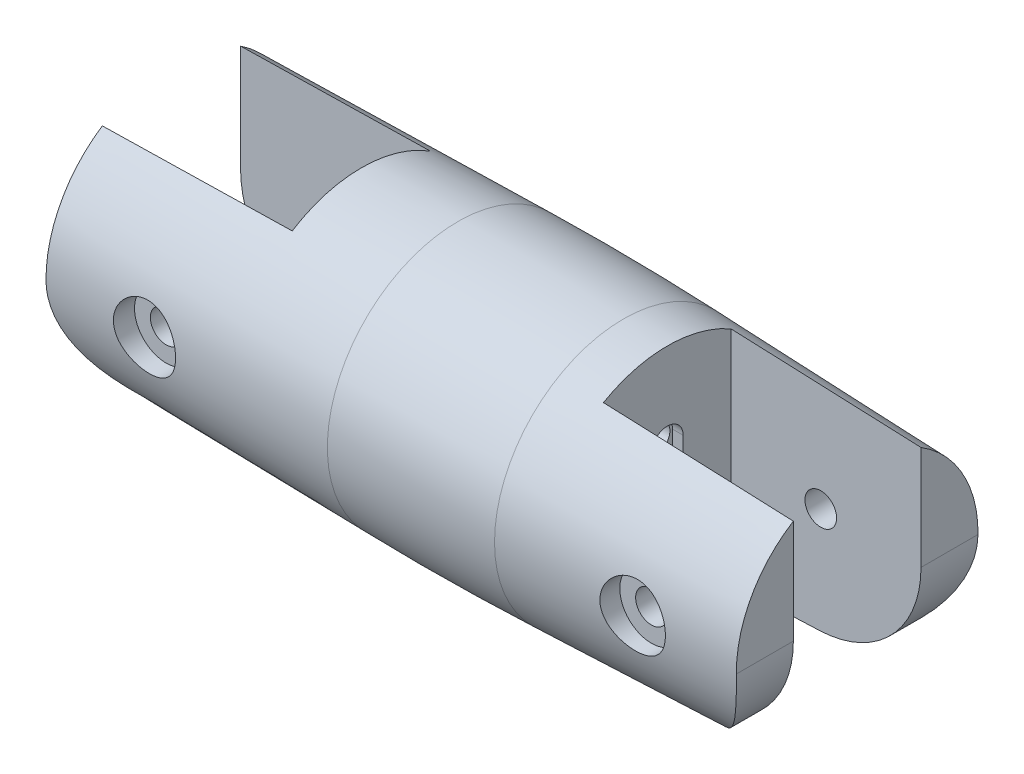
ISO-10303-21;
HEADER;
FILE_DESCRIPTION(('STEP AP214'),'2;1');
FILE_NAME('part.step','',(''),(''),'','','');
FILE_SCHEMA(('AUTOMOTIVE_DESIGN { 1 0 10303 214 1 1 1 1 }'));
ENDSEC;
DATA;
#1=APPLICATION_CONTEXT('core data for automotive mechanical design processes');
#2=APPLICATION_PROTOCOL_DEFINITION('international standard','automotive_design',2000,#1);
#3=PRODUCT_CONTEXT('',#1,'mechanical');
#4=PRODUCT('Part','Part','',(#3));
#5=PRODUCT_RELATED_PRODUCT_CATEGORY('part','',(#4));
#6=PRODUCT_DEFINITION_FORMATION('','',#4);
#7=PRODUCT_DEFINITION_CONTEXT('part definition',#1,'design');
#8=PRODUCT_DEFINITION('design','',#6,#7);
#9=PRODUCT_DEFINITION_SHAPE('','',#8);
#10=(LENGTH_UNIT() NAMED_UNIT(*) SI_UNIT(.MILLI.,.METRE.));
#11=(NAMED_UNIT(*) PLANE_ANGLE_UNIT() SI_UNIT($,.RADIAN.));
#12=(NAMED_UNIT(*) SI_UNIT($,.STERADIAN.) SOLID_ANGLE_UNIT());
#13=UNCERTAINTY_MEASURE_WITH_UNIT(LENGTH_MEASURE(1.E-05),#10,'distance_accuracy_value','');
#14=(GEOMETRIC_REPRESENTATION_CONTEXT(3) GLOBAL_UNCERTAINTY_ASSIGNED_CONTEXT((#13)) GLOBAL_UNIT_ASSIGNED_CONTEXT((#10,
#11,#12)) REPRESENTATION_CONTEXT('',''));
#15=CARTESIAN_POINT('',(0.,0.,0.));
#16=DIRECTION('',(0.,0.,1.));
#17=DIRECTION('',(1.,0.,0.));
#18=AXIS2_PLACEMENT_3D('',#15,#16,#17);
#19=CARTESIAN_POINT('',(0.,0.,0.));
#20=DIRECTION('',(-1.,0.,0.));
#21=DIRECTION('',(0.,0.,-1.));
#22=AXIS2_PLACEMENT_3D('',#19,#20,#21);
#23=CONICAL_SURFACE('',#22,12.5,0.0349065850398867);
#24=CARTESIAN_POINT('',(27.1790693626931,2.92207389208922,-11.1751711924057));
#25=CARTESIAN_POINT('',(24.5172285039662,2.92207389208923,-11.2712460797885));
#26=CARTESIAN_POINT('',(21.8553849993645,2.92207389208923,-11.3672475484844));
#27=CARTESIAN_POINT('',(16.5316926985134,2.92207389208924,-11.5591036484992));
#28=CARTESIAN_POINT('',(13.869843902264,2.92207389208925,-11.6549582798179));
#29=CARTESIAN_POINT('',(11.2079924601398,2.92207389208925,-11.7507394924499));
#30=B_SPLINE_CURVE_WITH_KNOTS('',3,(#24,#25,#26,#27,#28,#29),.UNSPECIFIED.,.F.,.F.,(4,2,4),(0.,
7.99072237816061,15.981444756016),.UNSPECIFIED.);
#31=CARTESIAN_POINT('',(22.2320508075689,2.92207389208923,-11.3536430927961));
#32=VERTEX_POINT('',#31);
#33=CARTESIAN_POINT('',(18.7679491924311,2.92207389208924,-11.4785121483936));
#34=VERTEX_POINT('',#33);
#35=EDGE_CURVE('E41',#32,#34,#30,.T.);
#36=ORIENTED_EDGE('',*,*,#35,.T.);
#37=CARTESIAN_POINT('',(16.9422726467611,-0.240090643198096,0.));
#38=DIRECTION('',(-0.866025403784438,0.500000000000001,0.));
#39=DIRECTION('',(-0.500000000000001,-0.866025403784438,0.));
#40=AXIS2_PLACEMENT_3D('',#37,#38,#39);
#41=ELLIPSE('',#40,13.7505929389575,11.9059422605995);
#42=CARTESIAN_POINT('',(17.0358983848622,-0.0779261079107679,-11.9048382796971));
#43=VERTEX_POINT('',#42);
#44=EDGE_CURVE('E11',#34,#43,#41,.T.);
#45=ORIENTED_EDGE('',*,*,#44,.T.);
#46=CARTESIAN_POINT('',(16.8522547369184,0.240154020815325,0.));
#47=DIRECTION('',(-0.86602540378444,-0.499999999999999,0.));
#48=DIRECTION('',(-0.499999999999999,0.86602540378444,0.));
#49=AXIS2_PLACEMENT_3D('',#46,#47,#48);
#50=ELLIPSE('',#49,13.7542227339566,11.9090851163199);
#51=CARTESIAN_POINT('',(18.7679491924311,-3.07792610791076,-11.437706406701));
#52=VERTEX_POINT('',#51);
#53=EDGE_CURVE('E245',#43,#52,#50,.T.);
#54=ORIENTED_EDGE('',*,*,#53,.T.);
#55=CARTESIAN_POINT('',(11.2065309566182,-3.07792610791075,-11.7109351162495));
#56=CARTESIAN_POINT('',(13.8683706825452,-3.07792610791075,-11.6148288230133));
#57=CARTESIAN_POINT('',(16.5302074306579,-3.07792610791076,-11.5186401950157));
#58=CARTESIAN_POINT('',(21.8538749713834,-3.07792610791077,-11.3260982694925));
#59=CARTESIAN_POINT('',(24.5157057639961,-3.07792610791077,-11.2297449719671));
#60=CARTESIAN_POINT('',(27.1775335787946,-3.07792610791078,-11.13330933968));
#61=B_SPLINE_CURVE_WITH_KNOTS('',3,(#55,#56,#57,#58,#59,#60),.UNSPECIFIED.,.F.,.F.,(4,2,4),(0.,
7.99072237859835,15.9814447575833),.UNSPECIFIED.);
#62=CARTESIAN_POINT('',(22.2320508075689,-3.07792610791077,-11.3123869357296));
#63=VERTEX_POINT('',#62);
#64=EDGE_CURVE('E1071',#52,#63,#61,.T.);
#65=ORIENTED_EDGE('',*,*,#64,.T.);
#66=CARTESIAN_POINT('',(23.8732932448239,-0.235210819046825,0.));
#67=DIRECTION('',(0.866025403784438,-0.500000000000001,0.));
#68=DIRECTION('',(-0.500000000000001,-0.866025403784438,0.));
#69=AXIS2_PLACEMENT_3D('',#66,#67,#68);
#70=ELLIPSE('',#69,13.471113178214,11.6639548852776);
#71=CARTESIAN_POINT('',(23.9641016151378,-0.0779261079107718,-11.6628948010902));
#72=VERTEX_POINT('',#71);
#73=EDGE_CURVE('E1068',#63,#72,#70,.T.);
#74=ORIENTED_EDGE('',*,*,#73,.T.);
#75=CARTESIAN_POINT('',(23.7832753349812,0.235274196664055,0.));
#76=DIRECTION('',(0.86602540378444,0.499999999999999,0.));
#77=DIRECTION('',(-0.499999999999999,0.86602540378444,0.));
#78=AXIS2_PLACEMENT_3D('',#75,#76,#77);
#79=ELLIPSE('',#78,13.474742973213,11.667097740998);
#80=EDGE_CURVE('E1066',#72,#32,#79,.T.);
#81=ORIENTED_EDGE('',*,*,#80,.T.);
#82=EDGE_LOOP('',(#36,#45,#54,#65,#74,#81));
#83=FACE_BOUND('',#82,.T.);
#84=CARTESIAN_POINT('',(29.999999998,-0.122642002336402,-11.4517202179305));
#85=CARTESIAN_POINT('',(30.0000038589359,-0.242247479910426,-11.4504410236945));
#86=CARTESIAN_POINT('',(29.9978583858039,-0.361815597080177,-11.4473589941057));
#87=CARTESIAN_POINT('',(29.9892932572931,-0.600645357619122,-11.4376136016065));
#88=CARTESIAN_POINT('',(29.9828738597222,-0.719907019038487,-11.4309504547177));
#89=CARTESIAN_POINT('',(29.9572578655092,-1.07667308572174,-11.4056418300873));
#90=CARTESIAN_POINT('',(29.9317033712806,-1.31339392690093,-11.381674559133));
#91=CARTESIAN_POINT('',(29.864407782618,-1.78079599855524,-11.3203066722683));
#92=CARTESIAN_POINT('',(29.8227936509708,-2.01150981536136,-11.2830115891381));
#93=CARTESIAN_POINT('',(29.7241147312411,-2.4671840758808,-11.1957364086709));
#94=CARTESIAN_POINT('',(29.6670478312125,-2.69214372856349,-11.1457545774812));
#95=CARTESIAN_POINT('',(29.538581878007,-3.13420223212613,-11.0342582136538));
#96=CARTESIAN_POINT('',(29.4672260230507,-3.35132250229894,-10.9727784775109));
#97=CARTESIAN_POINT('',(29.3110507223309,-3.77740752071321,-10.8392634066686));
#98=CARTESIAN_POINT('',(29.2262253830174,-3.98636864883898,-10.767223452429));
#99=CARTESIAN_POINT('',(29.0440364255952,-4.39550202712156,-10.6136724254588));
#100=CARTESIAN_POINT('',(28.9466558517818,-4.59566189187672,-10.5321485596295));
#101=CARTESIAN_POINT('',(28.740428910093,-4.98635076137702,-10.3608953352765));
#102=CARTESIAN_POINT('',(28.6315800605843,-5.17687766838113,-10.2711642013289));
#103=CARTESIAN_POINT('',(28.3599994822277,-5.61835881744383,-10.0492793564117));
#104=CARTESIAN_POINT('',(28.1924974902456,-5.86480007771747,-9.91395103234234));
#105=CARTESIAN_POINT('',(27.8394654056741,-6.33814806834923,-9.63298446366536));
#106=CARTESIAN_POINT('',(27.6539288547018,-6.5650477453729,-9.48734253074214));
#107=CARTESIAN_POINT('',(27.2658831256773,-6.99976578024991,-9.1883595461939));
#108=CARTESIAN_POINT('',(27.0633267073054,-7.20752743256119,-9.03499757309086));
#109=CARTESIAN_POINT('',(26.6428040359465,-7.60325114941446,-8.72409066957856));
#110=CARTESIAN_POINT('',(26.4248401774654,-7.79121627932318,-8.56654639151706));
#111=CARTESIAN_POINT('',(25.9693548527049,-8.1510904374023,-8.24738240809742));
#112=CARTESIAN_POINT('',(25.7315251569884,-8.32259378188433,-8.08574511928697));
#113=CARTESIAN_POINT('',(25.240046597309,-8.64507016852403,-7.7657007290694));
#114=CARTESIAN_POINT('',(24.9863903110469,-8.79603347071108,-7.60729519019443));
#115=CARTESIAN_POINT('',(24.4633175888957,-9.07642055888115,-7.29962296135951));
#116=CARTESIAN_POINT('',(24.1939511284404,-9.20590809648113,-7.15033008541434));
#117=CARTESIAN_POINT('',(23.6378801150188,-9.44255883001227,-6.8678169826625));
#118=CARTESIAN_POINT('',(23.351196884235,-9.54974878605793,-6.73457757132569));
#119=CARTESIAN_POINT('',(22.7491429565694,-9.74287552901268,-6.49014756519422));
#120=CARTESIAN_POINT('',(22.4331428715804,-9.8280087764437,-6.37981384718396));
#121=CARTESIAN_POINT('',(21.9462639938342,-9.93301661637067,-6.24629503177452));
#122=CARTESIAN_POINT('',(21.7821345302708,-9.96420101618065,-6.20716132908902));
#123=CARTESIAN_POINT('',(21.4501467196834,-10.0185637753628,-6.14124312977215));
#124=CARTESIAN_POINT('',(21.2822909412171,-10.0417474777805,-6.11445038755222));
#125=CARTESIAN_POINT('',(20.996433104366,-10.0737677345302,-6.08086037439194));
#126=CARTESIAN_POINT('',(20.8790940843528,-10.084823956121,-6.07044011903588));
#127=CARTESIAN_POINT('',(20.6434375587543,-10.1028232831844,-6.05644972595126));
#128=CARTESIAN_POINT('',(20.525118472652,-10.1097573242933,-6.05289464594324));
#129=CARTESIAN_POINT('',(20.4066821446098,-10.114569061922,-6.05292405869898));
#130=B_SPLINE_CURVE_WITH_KNOTS('',3,(#84,#85,#86,#87,#88,#89,#90,#91,#92,#93,#94,#95,#96,#97,
#98,#99,#100,#101,#102,#103,#104,#105,#106,#107,#108,#109,#110,#111,#112,#113,#114,#115,#116,
#117,#118,#119,#120,#121,#122,#123,#124,#125,#126,#127,#128,#129),.UNSPECIFIED.,.F.,.F.,(4,2,2,
2,2,2,2,2,2,2,2,2,2,2,2,2,2,2,2,2,2,2,4),(0.,0.358768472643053,0.717515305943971,
1.43430564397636,2.14554164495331,2.85687490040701,3.56608927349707,4.27561482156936,
4.98610881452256,5.6967568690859,6.67714163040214,7.65787878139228,8.64143417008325,
9.62483703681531,10.6282978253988,11.6322328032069,12.6331320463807,13.6328230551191,
14.6649895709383,15.1792068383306,15.6930800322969,16.0477782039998,16.4032534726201),.UNSPECIFIED.);
#131=CARTESIAN_POINT('',(30.,-0.122842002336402,-11.4517180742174));
#132=VERTEX_POINT('',#131);
#133=CARTESIAN_POINT('',(20.4068821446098,-10.1145609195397,-6.05292406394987));
#134=VERTEX_POINT('',#133);
#135=EDGE_CURVE('E392',#132,#134,#130,.T.);
#136=ORIENTED_EDGE('',*,*,#135,.T.);
#137=CARTESIAN_POINT('',(21.0000000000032,-10.0904080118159,0.));
#138=DIRECTION('',(-0.0406882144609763,0.999171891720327,0.));
#139=DIRECTION('',(-0.999171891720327,-0.0406882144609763,0.));
#140=AXIS2_PLACEMENT_3D('',#137,#138,#139);
#141=ELLIPSE('',#140,289.190960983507,6.05293681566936);
#142=CARTESIAN_POINT('',(12.,-10.4569054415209,-6.05));
#143=VERTEX_POINT('',#142);
#144=EDGE_CURVE('E761',#134,#143,#141,.T.);
#145=ORIENTED_EDGE('',*,*,#144,.T.);
#146=CARTESIAN_POINT('',(12.,0.,0.));
#147=DIRECTION('',(-1.,0.,0.));
#148=DIRECTION('',(0.,0.,1.));
#149=AXIS2_PLACEMENT_3D('',#146,#147,#148);
#150=CIRCLE('',#149,12.080950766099);
#151=CARTESIAN_POINT('',(12.,-10.4569054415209,6.05));
#152=VERTEX_POINT('',#151);
#153=EDGE_CURVE('E678',#143,#152,#150,.T.);
#154=ORIENTED_EDGE('',*,*,#153,.T.);
#155=CARTESIAN_POINT('',(20.4068821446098,-10.1145609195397,6.05292406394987));
#156=VERTEX_POINT('',#155);
#157=EDGE_CURVE('E726',#152,#156,#141,.T.);
#158=ORIENTED_EDGE('',*,*,#157,.T.);
#159=CARTESIAN_POINT('',(20.4066821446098,-10.114569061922,6.05292405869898));
#160=CARTESIAN_POINT('',(20.5777279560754,-10.1076488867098,6.05279007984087));
#161=CARTESIAN_POINT('',(20.7484940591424,-10.096259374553,6.06027259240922));
#162=CARTESIAN_POINT('',(21.0876672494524,-10.0649590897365,6.0892993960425));
#163=CARTESIAN_POINT('',(21.25607875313,-10.0450674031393,6.11081224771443));
#164=CARTESIAN_POINT('',(21.5869051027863,-9.99752159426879,6.16629961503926));
#165=CARTESIAN_POINT('',(21.7493725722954,-9.96999410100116,6.20007340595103));
#166=CARTESIAN_POINT('',(22.0702876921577,-9.90755673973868,6.27845702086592));
#167=CARTESIAN_POINT('',(22.228732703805,-9.8726421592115,6.32307376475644));
#168=CARTESIAN_POINT('',(22.6096764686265,-9.77909227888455,6.44298176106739));
#169=CARTESIAN_POINT('',(22.8297393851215,-9.71677418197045,6.52313830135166));
#170=CARTESIAN_POINT('',(23.2600726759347,-9.57921662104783,6.69732376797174));
#171=CARTESIAN_POINT('',(23.47033864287,-9.50397141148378,6.79135886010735));
#172=CARTESIAN_POINT('',(23.8831738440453,-9.34079476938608,6.99008507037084));
#173=CARTESIAN_POINT('',(24.0856591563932,-9.25275761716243,7.09486260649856));
#174=CARTESIAN_POINT('',(24.4814357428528,-9.06513945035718,7.31107533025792));
#175=CARTESIAN_POINT('',(24.6747274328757,-8.96555895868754,7.42251021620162));
#176=CARTESIAN_POINT('',(25.143308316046,-8.70473371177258,7.70390680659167));
#177=CARTESIAN_POINT('',(25.4134505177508,-8.53682408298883,7.87630017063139));
#178=CARTESIAN_POINT('',(25.935623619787,-8.17696595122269,8.22361124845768));
#179=CARTESIAN_POINT('',(26.1876463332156,-7.98500668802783,8.39853006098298));
#180=CARTESIAN_POINT('',(26.67273606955,-7.57767980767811,8.74538920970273));
#181=CARTESIAN_POINT('',(26.9058528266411,-7.36237733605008,8.91733635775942));
#182=CARTESIAN_POINT('',(27.352857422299,-6.90789871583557,9.25438688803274));
#183=CARTESIAN_POINT('',(27.5667534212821,-6.668732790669,9.4194931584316));
#184=CARTESIAN_POINT('',(27.9260355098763,-6.22523984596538,9.7015164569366));
#185=CARTESIAN_POINT('',(28.0757499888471,-6.02583391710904,9.82067764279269));
#186=CARTESIAN_POINT('',(28.3617739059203,-5.61317305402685,10.0508005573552));
#187=CARTESIAN_POINT('',(28.4980862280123,-5.39992111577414,10.1617640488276));
#188=CARTESIAN_POINT('',(28.7559248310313,-4.96006476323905,10.3735811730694));
#189=CARTESIAN_POINT('',(28.8774605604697,-4.73346902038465,10.4744412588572));
#190=CARTESIAN_POINT('',(29.1043254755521,-4.26752028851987,10.6642306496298));
#191=CARTESIAN_POINT('',(29.209657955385,-4.02816990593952,10.7531623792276));
#192=CARTESIAN_POINT('',(29.3865098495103,-3.57852272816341,10.9036131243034));
#193=CARTESIAN_POINT('',(29.460739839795,-3.36999201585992,10.967232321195));
#194=CARTESIAN_POINT('',(29.5958634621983,-2.94577193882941,11.0838246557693));
#195=CARTESIAN_POINT('',(29.6567597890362,-2.73008403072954,11.1367999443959));
#196=CARTESIAN_POINT('',(29.7642561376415,-2.293061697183,11.2310870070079));
#197=CARTESIAN_POINT('',(29.8108796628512,-2.07173721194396,11.2724179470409));
#198=CARTESIAN_POINT('',(29.8891946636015,-1.6246092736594,11.3427246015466));
#199=CARTESIAN_POINT('',(29.9208932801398,-1.39880801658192,11.3717062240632));
#200=CARTESIAN_POINT('',(29.9631748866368,-0.997859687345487,11.4114476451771));
#201=CARTESIAN_POINT('',(29.9769727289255,-0.823307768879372,11.424891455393));
#202=CARTESIAN_POINT('',(29.9953915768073,-0.473406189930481,11.444093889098));
#203=CARTESIAN_POINT('',(30.0000180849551,-0.298057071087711,11.449857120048));
#204=CARTESIAN_POINT('',(29.999999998,-0.122642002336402,11.4517202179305));
#205=B_SPLINE_CURVE_WITH_KNOTS('',3,(#159,#160,#161,#162,#163,#164,#165,#166,#167,#168,#169,
#170,#171,#172,#173,#174,#175,#176,#177,#178,#179,#180,#181,#182,#183,#184,#185,#186,#187,#188,
#189,#190,#191,#192,#193,#194,#195,#196,#197,#198,#199,#200,#201,#202,#203,#204),.UNSPECIFIED.,
.F.,.F.,(4,2,2,2,2,2,2,2,2,2,2,2,2,2,2,2,2,2,2,2,2,2,4),(0.,0.513181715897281,1.02521741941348,
1.52922297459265,2.03355103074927,2.75941171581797,3.48559585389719,4.21816452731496,
4.95070002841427,6.03465007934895,7.11908685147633,8.20057153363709,9.28159486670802,
10.1099727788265,10.9381720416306,11.7658389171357,12.5933373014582,13.2835787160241,
13.9736805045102,14.662639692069,15.3512689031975,15.8777108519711,16.4038368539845),.UNSPECIFIED.);
#206=CARTESIAN_POINT('',(30.,-0.122842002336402,11.4517180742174));
#207=VERTEX_POINT('',#206);
#208=EDGE_CURVE('E384',#156,#207,#205,.T.);
#209=ORIENTED_EDGE('',*,*,#208,.T.);
#210=CARTESIAN_POINT('',(30.,0.,0.));
#211=DIRECTION('',(1.,0.,0.));
#212=DIRECTION('',(0.,0.,-1.));
#213=AXIS2_PLACEMENT_3D('',#210,#211,#212);
#214=CIRCLE('',#213,11.4523769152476);
#215=CARTESIAN_POINT('',(30.,9.72391058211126,6.05));
#216=VERTEX_POINT('',#215);
#217=EDGE_CURVE('E693',#216,#207,#214,.T.);
#218=ORIENTED_EDGE('',*,*,#217,.F.);
#219=CARTESIAN_POINT('',(-6.48507262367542,11.1964449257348,6.05000000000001));
#220=CARTESIAN_POINT('',(-2.64794589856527,11.0441321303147,6.05));
#221=CARTESIAN_POINT('',(1.18915358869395,10.8911308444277,6.05));
#222=CARTESIAN_POINT('',(8.86328985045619,10.5835350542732,6.05));
#223=CARTESIAN_POINT('',(12.7003266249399,10.4289405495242,6.05));
#224=CARTESIAN_POINT('',(20.3743269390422,10.1179421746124,6.05));
#225=CARTESIAN_POINT('',(24.2112904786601,9.96153830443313,6.05));
#226=CARTESIAN_POINT('',(31.885131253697,9.64664613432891,6.05));
#227=CARTESIAN_POINT('',(35.7220084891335,9.48815783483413,6.05));
#228=CARTESIAN_POINT('',(44.4627885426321,9.12435129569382,6.05));
#229=CARTESIAN_POINT('',(49.366659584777,8.91826819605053,6.05));
#230=CARTESIAN_POINT('',(59.174195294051,8.50126377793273,6.05));
#231=CARTESIAN_POINT('',(64.0778599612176,8.29034246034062,6.05));
#232=CARTESIAN_POINT('',(73.8849362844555,7.86244456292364,6.04999999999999));
#233=CARTESIAN_POINT('',(78.7883479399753,7.64546797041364,6.04999999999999));
#234=CARTESIAN_POINT('',(86.1432040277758,7.31415519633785,6.04999999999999));
#235=CARTESIAN_POINT('',(88.5947801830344,7.20274290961,6.04999999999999));
#236=CARTESIAN_POINT('',(93.4978292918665,6.97765955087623,6.04999999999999));
#237=CARTESIAN_POINT('',(95.9493022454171,6.8639884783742,6.04999999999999));
#238=CARTESIAN_POINT('',(98.4007153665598,6.7490332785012,6.04999999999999));
#239=B_SPLINE_CURVE_WITH_KNOTS('',3,(#219,#220,#221,#222,#223,#224,#225,#226,#227,#228,#229,
#230,#231,#232,#233,#234,#235,#236,#237,#238),.UNSPECIFIED.,.F.,.F.,(4,2,2,2,2,2,2,2,2,4),(0.,
11.5204456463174,23.0408947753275,34.5613440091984,46.0817908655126,60.8063870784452,
75.5309806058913,90.2556049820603,97.6179233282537,104.980243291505),.UNSPECIFIED.);
#240=CARTESIAN_POINT('',(12.,10.4569054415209,6.05));
#241=VERTEX_POINT('',#240);
#242=EDGE_CURVE('E634',#216,#241,#239,.F.);
#243=ORIENTED_EDGE('',*,*,#242,.T.);
#244=CARTESIAN_POINT('',(12.,10.4569054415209,-6.05));
#245=VERTEX_POINT('',#244);
#246=EDGE_CURVE('E679',#241,#245,#150,.T.);
#247=ORIENTED_EDGE('',*,*,#246,.T.);
#248=CARTESIAN_POINT('',(-6.48507262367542,11.1964449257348,-6.04999999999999));
#249=CARTESIAN_POINT('',(-2.64794589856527,11.0441321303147,-6.05));
#250=CARTESIAN_POINT('',(1.18915358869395,10.8911308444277,-6.05));
#251=CARTESIAN_POINT('',(8.86328985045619,10.5835350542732,-6.05));
#252=CARTESIAN_POINT('',(12.7003266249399,10.4289405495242,-6.05));
#253=CARTESIAN_POINT('',(20.3743269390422,10.1179421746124,-6.05));
#254=CARTESIAN_POINT('',(24.2112904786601,9.96153830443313,-6.05));
#255=CARTESIAN_POINT('',(31.885131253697,9.64664613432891,-6.05));
#256=CARTESIAN_POINT('',(35.7220084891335,9.48815783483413,-6.05));
#257=CARTESIAN_POINT('',(44.4627885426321,9.12435129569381,-6.05));
#258=CARTESIAN_POINT('',(49.366659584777,8.91826819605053,-6.05));
#259=CARTESIAN_POINT('',(59.174195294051,8.50126377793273,-6.05));
#260=CARTESIAN_POINT('',(64.0778599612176,8.29034246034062,-6.05));
#261=CARTESIAN_POINT('',(73.8849362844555,7.86244456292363,-6.05000000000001));
#262=CARTESIAN_POINT('',(78.7883479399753,7.64546797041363,-6.05000000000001));
#263=CARTESIAN_POINT('',(86.1432040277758,7.31415519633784,-6.05000000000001));
#264=CARTESIAN_POINT('',(88.5947801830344,7.20274290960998,-6.05000000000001));
#265=CARTESIAN_POINT('',(93.4978292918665,6.97765955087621,-6.05000000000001));
#266=CARTESIAN_POINT('',(95.9493022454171,6.86398847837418,-6.05000000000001));
#267=CARTESIAN_POINT('',(98.4007153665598,6.74903327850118,-6.05000000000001));
#268=B_SPLINE_CURVE_WITH_KNOTS('',3,(#248,#249,#250,#251,#252,#253,#254,#255,#256,#257,#258,
#259,#260,#261,#262,#263,#264,#265,#266,#267),.UNSPECIFIED.,.F.,.F.,(4,2,2,2,2,2,2,2,2,4),(0.,
11.5204456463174,23.0408947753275,34.5613440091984,46.0817908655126,60.8063870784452,
75.5309806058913,90.2556049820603,97.6179233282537,104.980243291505),.UNSPECIFIED.);
#269=CARTESIAN_POINT('',(30.,9.72391058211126,-6.05));
#270=VERTEX_POINT('',#269);
#271=EDGE_CURVE('E637',#245,#270,#268,.T.);
#272=ORIENTED_EDGE('',*,*,#271,.T.);
#273=EDGE_CURVE('E694',#132,#270,#214,.T.);
#274=ORIENTED_EDGE('',*,*,#273,.F.);
#275=EDGE_LOOP('',(#136,#145,#154,#158,#209,#218,#243,#247,#272,#274));
#276=FACE_BOUND('',#275,.T.);
#277=CARTESIAN_POINT('',(7.85099094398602,0.,0.));
#278=DIRECTION('',(-1.,0.,0.));
#279=DIRECTION('',(0.,0.,1.));
#280=AXIS2_PLACEMENT_3D('',#277,#278,#279);
#281=CIRCLE('',#280,12.2258373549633);
#282=CARTESIAN_POINT('',(7.85099094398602,0.,12.2258373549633));
#283=VERTEX_POINT('',#282);
#284=EDGE_CURVE('E548',#283,#283,#281,.F.);
#285=ORIENTED_EDGE('',*,*,#284,.T.);
#286=EDGE_LOOP('',(#285));
#287=FACE_BOUND('',#286,.T.);
#288=CARTESIAN_POINT('',(18.4443083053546,-2.26290474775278,11.6379498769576));
#289=CARTESIAN_POINT('',(18.5668948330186,-2.37823295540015,11.611164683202));
#290=CARTESIAN_POINT('',(18.699222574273,-2.48325037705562,11.5842300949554));
#291=CARTESIAN_POINT('',(18.9799703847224,-2.66982512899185,11.5325989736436));
#292=CARTESIAN_POINT('',(19.1283983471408,-2.75137087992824,11.5079035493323));
#293=CARTESIAN_POINT('',(19.437634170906,-2.88862231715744,11.4630879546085));
#294=CARTESIAN_POINT('',(19.5984553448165,-2.94429975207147,11.4429727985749));
#295=CARTESIAN_POINT('',(19.9278165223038,-3.02774756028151,11.4092799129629));
#296=CARTESIAN_POINT('',(20.0963539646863,-3.05552712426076,11.39570003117));
#297=CARTESIAN_POINT('',(20.4319507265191,-3.08175644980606,11.3764932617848));
#298=CARTESIAN_POINT('',(20.5989441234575,-3.08091211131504,11.3706786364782));
#299=CARTESIAN_POINT('',(20.93056281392,-3.05152963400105,11.3666088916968));
#300=CARTESIAN_POINT('',(21.0951882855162,-3.02299358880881,11.3683532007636));
#301=CARTESIAN_POINT('',(21.4139451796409,-2.93996867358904,11.3786047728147));
#302=CARTESIAN_POINT('',(21.5682215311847,-2.88601656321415,11.3869744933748));
#303=CARTESIAN_POINT('',(21.8656833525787,-2.75400441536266,11.4089332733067));
#304=CARTESIAN_POINT('',(22.0088676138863,-2.67594175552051,11.4225229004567));
#305=CARTESIAN_POINT('',(22.2830360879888,-2.4962217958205,11.4533522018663));
#306=CARTESIAN_POINT('',(22.4137399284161,-2.39414803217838,11.4706557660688));
#307=CARTESIAN_POINT('',(22.6565079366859,-2.17000116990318,11.5065346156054));
#308=CARTESIAN_POINT('',(22.7685692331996,-2.04792499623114,11.5251100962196));
#309=CARTESIAN_POINT('',(22.9736785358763,-1.78367237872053,11.5617408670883));
#310=CARTESIAN_POINT('',(23.0661870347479,-1.64107307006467,11.5797718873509));
#311=CARTESIAN_POINT('',(23.2259495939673,-1.34201983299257,11.6126096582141));
#312=CARTESIAN_POINT('',(23.2932048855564,-1.18556658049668,11.6274165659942));
#313=CARTESIAN_POINT('',(23.400067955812,-0.864129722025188,11.6519570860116));
#314=CARTESIAN_POINT('',(23.439837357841,-0.699202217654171,11.6617202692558));
#315=CARTESIAN_POINT('',(23.4910407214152,-0.364771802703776,11.6751756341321));
#316=CARTESIAN_POINT('',(23.5024790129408,-0.195269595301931,11.678868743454));
#317=CARTESIAN_POINT('',(23.496686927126,0.139525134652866,11.6798179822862));
#318=CARTESIAN_POINT('',(23.4800801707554,0.304828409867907,11.6772135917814));
#319=CARTESIAN_POINT('',(23.4199089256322,0.630249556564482,11.6662818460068));
#320=CARTESIAN_POINT('',(23.3763443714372,0.790367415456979,11.657954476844));
#321=CARTESIAN_POINT('',(23.2636562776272,1.10082523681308,11.6366979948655));
#322=CARTESIAN_POINT('',(23.1945566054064,1.25117417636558,11.623773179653));
#323=CARTESIAN_POINT('',(23.0327822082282,1.53829683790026,11.594971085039));
#324=CARTESIAN_POINT('',(22.9401042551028,1.67506869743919,11.5790934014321));
#325=CARTESIAN_POINT('',(22.7315186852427,1.93417544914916,11.5460578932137));
#326=CARTESIAN_POINT('',(22.6151699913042,2.05615295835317,11.5288803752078));
#327=CARTESIAN_POINT('',(22.3636018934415,2.27902747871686,11.495858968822));
#328=CARTESIAN_POINT('',(22.2283813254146,2.37992318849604,11.4800151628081));
#329=CARTESIAN_POINT('',(21.9416235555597,2.55844391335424,11.4518220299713));
#330=CARTESIAN_POINT('',(21.7899746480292,2.6358940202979,11.4394990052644));
#331=CARTESIAN_POINT('',(21.4754676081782,2.76413095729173,11.4204946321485));
#332=CARTESIAN_POINT('',(21.3126115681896,2.81492274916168,11.4138122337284));
#333=CARTESIAN_POINT('',(20.9841602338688,2.88741559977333,11.4075194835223));
#334=CARTESIAN_POINT('',(20.8187031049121,2.90972957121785,11.4077574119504));
#335=CARTESIAN_POINT('',(20.4865550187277,2.92664797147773,11.4154035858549));
#336=CARTESIAN_POINT('',(20.3198641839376,2.92125511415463,11.4228111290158));
#337=CARTESIAN_POINT('',(19.9927608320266,2.8833894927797,11.444205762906));
#338=CARTESIAN_POINT('',(19.8322905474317,2.85135102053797,11.4580857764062));
#339=CARTESIAN_POINT('',(19.5191817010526,2.76188302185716,11.4912235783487));
#340=CARTESIAN_POINT('',(19.3665440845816,2.70445043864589,11.5104820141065));
#341=CARTESIAN_POINT('',(19.0700572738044,2.56454737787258,11.5530709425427));
#342=CARTESIAN_POINT('',(18.9264427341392,2.48160243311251,11.5764746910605));
#343=CARTESIAN_POINT('',(18.6549623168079,2.29338793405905,11.6248874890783));
#344=CARTESIAN_POINT('',(18.5270994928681,2.18811406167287,11.649896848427));
#345=CARTESIAN_POINT('',(18.2868903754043,1.95456156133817,11.6998848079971));
#346=CARTESIAN_POINT('',(18.1750997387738,1.82570569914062,11.7248416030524));
#347=CARTESIAN_POINT('',(17.9747066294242,1.55052670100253,11.7714496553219));
#348=CARTESIAN_POINT('',(17.8861035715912,1.4042040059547,11.7931009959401));
#349=CARTESIAN_POINT('',(17.7352450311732,1.09891165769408,11.8307326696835));
#350=CARTESIAN_POINT('',(17.672841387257,0.940019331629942,11.8467448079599));
#351=CARTESIAN_POINT('',(17.575790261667,0.613444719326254,11.8715270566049));
#352=CARTESIAN_POINT('',(17.5411352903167,0.445764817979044,11.8802991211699));
#353=CARTESIAN_POINT('',(17.5015178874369,0.112562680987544,11.889428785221));
#354=CARTESIAN_POINT('',(17.4955771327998,-0.0528360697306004,11.8900648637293));
#355=CARTESIAN_POINT('',(17.5109222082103,-0.382211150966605,11.8835009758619));
#356=CARTESIAN_POINT('',(17.5322079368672,-0.546187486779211,11.8763010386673));
#357=CARTESIAN_POINT('',(17.6007043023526,-0.865565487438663,11.8548756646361));
#358=CARTESIAN_POINT('',(17.6475263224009,-1.02105817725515,11.8407558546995));
#359=CARTESIAN_POINT('',(17.7652932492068,-1.32189597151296,11.80681708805));
#360=CARTESIAN_POINT('',(17.8362310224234,-1.46724406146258,11.7869998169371));
#361=CARTESIAN_POINT('',(17.9900199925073,-1.72714546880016,11.7461119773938));
#362=CARTESIAN_POINT('',(18.070329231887,-1.8432869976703,11.7254960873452));
#363=CARTESIAN_POINT('',(18.2462604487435,-2.06298756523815,11.682604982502));
#364=CARTESIAN_POINT('',(18.3418841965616,-2.16654514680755,11.6603295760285));
#365=CARTESIAN_POINT('',(18.4443083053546,-2.26290474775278,11.6379498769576));
#366=B_SPLINE_CURVE_WITH_KNOTS('',3,(#288,#289,#290,#291,#292,#293,#294,#295,#296,#297,#298,
#299,#300,#301,#302,#303,#304,#305,#306,#307,#308,#309,#310,#311,#312,#313,#314,#315,#316,#317,
#318,#319,#320,#321,#322,#323,#324,#325,#326,#327,#328,#329,#330,#331,#332,#333,#334,#335,#336,
#337,#338,#339,#340,#341,#342,#343,#344,#345,#346,#347,#348,#349,#350,#351,#352,#353,#354,#355,
#356,#357,#358,#359,#360,#361,#362,#363,#364,#365),.UNSPECIFIED.,.T.,.F.,(4,2,2,2,2,2,2,2,2,2,2,
2,2,2,2,2,2,2,2,2,2,2,2,2,2,2,2,2,2,2,2,2,2,2,2,2,2,2,4),(0.,0.51078521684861,1.02182199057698,
1.53341557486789,2.04484056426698,2.54366258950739,3.04244690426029,3.53113979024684,
4.01988584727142,4.51783156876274,5.01585391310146,5.52620806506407,6.0365373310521,
6.54383961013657,7.05106435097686,7.54715812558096,8.04325310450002,8.53888555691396,
9.03458590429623,9.5405455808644,10.0465364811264,10.5562140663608,11.0657967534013,
11.5642160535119,12.0625865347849,12.5529898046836,13.0434521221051,13.543652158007,
14.043949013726,14.5587139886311,15.0734659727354,15.5852664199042,16.0969286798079,
16.5910289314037,17.0851273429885,17.57190815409,18.0585450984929,18.4852695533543,
18.912043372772),.UNSPECIFIED.);
#367=CARTESIAN_POINT('',(18.4443083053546,-2.26290474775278,11.6379498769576));
#368=VERTEX_POINT('',#367);
#369=EDGE_CURVE('E321',#368,#368,#366,.T.);
#370=ORIENTED_EDGE('',*,*,#369,.F.);
#371=EDGE_LOOP('',(#370));
#372=FACE_BOUND('',#371,.T.);
#373=ADVANCED_FACE('F33',(#83,#276,#287,#372),#23,.T.);
#374=CARTESIAN_POINT('',(20.5,-0.0779261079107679,-12.5));
#375=DIRECTION('',(0.,0.,1.));
#376=DIRECTION('',(1.,0.,0.));
#377=AXIS2_PLACEMENT_3D('',#374,#375,#376);
#378=CYLINDRICAL_SURFACE('',#377,1.5);
#379=CARTESIAN_POINT('',(20.5,-0.0779261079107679,6.05));
#380=DIRECTION('',(0.,0.,1.));
#381=DIRECTION('',(1.,0.,0.));
#382=AXIS2_PLACEMENT_3D('',#379,#380,#381);
#383=CIRCLE('',#382,1.5);
#384=CARTESIAN_POINT('',(22.,-0.0779261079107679,6.05));
#385=VERTEX_POINT('',#384);
#386=EDGE_CURVE('E367',#385,#385,#383,.T.);
#387=ORIENTED_EDGE('',*,*,#386,.F.);
#388=EDGE_LOOP('',(#387));
#389=FACE_BOUND('',#388,.T.);
#390=CARTESIAN_POINT('',(20.5,-0.0779261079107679,10.));
#391=DIRECTION('',(0.,0.,1.));
#392=DIRECTION('',(1.,0.,0.));
#393=AXIS2_PLACEMENT_3D('',#390,#391,#392);
#394=CIRCLE('',#393,1.5);
#395=CARTESIAN_POINT('',(22.,-0.0779261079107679,10.));
#396=VERTEX_POINT('',#395);
#397=EDGE_CURVE('E316',#396,#396,#394,.F.);
#398=ORIENTED_EDGE('',*,*,#397,.F.);
#399=EDGE_LOOP('',(#398));
#400=FACE_BOUND('',#399,.T.);
#401=ADVANCED_FACE('F441',(#389,#400),#378,.F.);
#402=CARTESIAN_POINT('',(0.,0.,0.));
#403=DIRECTION('',(1.,0.,0.));
#404=DIRECTION('',(0.,0.,-1.));
#405=AXIS2_PLACEMENT_3D('',#402,#403,#404);
#406=CONICAL_SURFACE('',#405,12.5,0.0174532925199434);
#407=CARTESIAN_POINT('',(-28.8493114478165,0.120896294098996,0.));
#408=DIRECTION('',(-0.866025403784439,0.5,0.));
#409=DIRECTION('',(0.5,0.866025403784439,0.));
#410=AXIS2_PLACEMENT_3D('',#407,#408,#409);
#411=ELLIPSE('',#410,13.8522881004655,11.9958242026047);
#412=CARTESIAN_POINT('',(-28.9641016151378,-0.0779261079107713,-11.9941765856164));
#413=VERTEX_POINT('',#412);
#414=CARTESIAN_POINT('',(-27.2320508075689,2.92207389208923,-11.6642187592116));
#415=VERTEX_POINT('',#414);
#416=EDGE_CURVE('E1079',#413,#415,#411,.F.);
#417=ORIENTED_EDGE('',*,*,#416,.F.);
#418=CARTESIAN_POINT('',(-28.9393019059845,-0.120880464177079,0.));
#419=DIRECTION('',(-0.866025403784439,-0.5,0.));
#420=DIRECTION('',(0.5,-0.866025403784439,0.));
#421=AXIS2_PLACEMENT_3D('',#418,#419,#420);
#422=ELLIPSE('',#421,13.8504743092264,11.994253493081);
#423=CARTESIAN_POINT('',(-27.2320508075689,-3.07792610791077,-11.6240649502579));
#424=VERTEX_POINT('',#423);
#425=EDGE_CURVE('E481',#424,#413,#422,.F.);
#426=ORIENTED_EDGE('',*,*,#425,.F.);
#427=CARTESIAN_POINT('',(-18.540732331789,-3.07792610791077,-11.7809322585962));
#428=CARTESIAN_POINT('',(-21.2914287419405,-3.07792610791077,-11.731307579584));
#429=CARTESIAN_POINT('',(-24.0421247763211,-3.07792610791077,-11.681662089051));
#430=CARTESIAN_POINT('',(-29.5435160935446,-3.07792610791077,-11.5823294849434));
#431=CARTESIAN_POINT('',(-32.2942113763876,-3.07792610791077,-11.5326423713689));
#432=CARTESIAN_POINT('',(-35.0449062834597,-3.07792610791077,-11.4829344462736));
#433=B_SPLINE_CURVE_WITH_KNOTS('',3,(#427,#428,#429,#430,#431,#432),.UNSPECIFIED.,.F.,.F.,(4,2,
4),(0.,8.25343202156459,16.5068640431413),.UNSPECIFIED.);
#434=CARTESIAN_POINT('',(-23.7679491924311,-3.07792610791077,-11.6866039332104));
#435=VERTEX_POINT('',#434);
#436=EDGE_CURVE('E473',#435,#424,#433,.T.);
#437=ORIENTED_EDGE('',*,*,#436,.F.);
#438=CARTESIAN_POINT('',(-21.9204045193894,0.122115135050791,0.));
#439=DIRECTION('',(0.866025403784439,-0.5,0.));
#440=DIRECTION('',(0.5,0.866025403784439,0.));
#441=AXIS2_PLACEMENT_3D('',#438,#439,#440);
#442=ELLIPSE('',#441,13.9919428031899,12.1167625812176);
#443=CARTESIAN_POINT('',(-22.0358983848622,-0.0779261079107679,-12.1151113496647));
#444=VERTEX_POINT('',#443);
#445=EDGE_CURVE('E480',#444,#435,#442,.F.);
#446=ORIENTED_EDGE('',*,*,#445,.F.);
#447=CARTESIAN_POINT('',(-22.0103949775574,-0.122099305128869,0.));
#448=DIRECTION('',(0.866025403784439,0.5,0.));
#449=DIRECTION('',(0.5,-0.866025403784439,0.));
#450=AXIS2_PLACEMENT_3D('',#447,#448,#449);
#451=ELLIPSE('',#450,13.9901290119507,12.1151918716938);
#452=CARTESIAN_POINT('',(-23.7679491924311,2.92207389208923,-11.7265435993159));
#453=VERTEX_POINT('',#452);
#454=EDGE_CURVE('E1086',#453,#444,#451,.F.);
#455=ORIENTED_EDGE('',*,*,#454,.F.);
#456=CARTESIAN_POINT('',(-35.0456553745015,2.92207389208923,-11.5235665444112));
#457=CARTESIAN_POINT('',(-32.2949573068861,2.92207389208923,-11.5730992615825));
#458=CARTESIAN_POINT('',(-29.5442589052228,2.92207389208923,-11.6226134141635));
#459=CARTESIAN_POINT('',(-24.0428614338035,2.92207389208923,-11.7216045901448));
#460=CARTESIAN_POINT('',(-21.2921623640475,2.92207389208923,-11.7710816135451));
#461=CARTESIAN_POINT('',(-18.5414629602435,2.92207389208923,-11.8205400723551));
#462=B_SPLINE_CURVE_WITH_KNOTS('',3,(#456,#457,#458,#459,#460,#461),.UNSPECIFIED.,.F.,.F.,(4,2,
4),(0.,8.25343202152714,16.5068640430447),.UNSPECIFIED.);
#463=EDGE_CURVE('E1082',#415,#453,#462,.T.);
#464=ORIENTED_EDGE('',*,*,#463,.F.);
#465=EDGE_LOOP('',(#417,#426,#437,#446,#455,#464));
#466=FACE_BOUND('',#465,.T.);
#467=CARTESIAN_POINT('',(-25.2077489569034,-10.1257467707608,6.55078487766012));
#468=CARTESIAN_POINT('',(-25.384900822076,-10.1221080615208,6.5506524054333));
#469=CARTESIAN_POINT('',(-25.5618665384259,-10.1136800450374,6.55805643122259));
#470=CARTESIAN_POINT('',(-25.9136256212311,-10.0876287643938,6.58686788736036));
#471=CARTESIAN_POINT('',(-26.0884226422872,-10.0700240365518,6.60824711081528));
#472=CARTESIAN_POINT('',(-26.4321959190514,-10.0263122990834,6.66353347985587));
#473=CARTESIAN_POINT('',(-26.6012200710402,-10.0003354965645,6.69724977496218));
#474=CARTESIAN_POINT('',(-26.9352991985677,-9.94031715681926,6.7756660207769));
#475=CARTESIAN_POINT('',(-27.1003518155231,-9.90627095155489,6.8203723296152));
#476=CARTESIAN_POINT('',(-27.4923459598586,-9.8151956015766,6.93922375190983));
#477=CARTESIAN_POINT('',(-27.7170422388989,-9.7544582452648,7.01793591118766));
#478=CARTESIAN_POINT('',(-28.1568140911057,-9.61934879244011,7.18919912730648));
#479=CARTESIAN_POINT('',(-28.3718856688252,-9.5449710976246,7.28175586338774));
#480=CARTESIAN_POINT('',(-28.7942205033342,-9.38292835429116,7.47759369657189));
#481=CARTESIAN_POINT('',(-29.0014063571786,-9.29516051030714,7.58095562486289));
#482=CARTESIAN_POINT('',(-29.4064553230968,-9.10749111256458,7.79454986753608));
#483=CARTESIAN_POINT('',(-29.6043186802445,-9.0075898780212,7.90478200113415));
#484=CARTESIAN_POINT('',(-30.0770813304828,-8.74908069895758,8.17947708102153));
#485=CARTESIAN_POINT('',(-30.3471602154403,-8.58410669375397,8.34627965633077));
#486=CARTESIAN_POINT('',(-30.8694224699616,-8.23033464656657,8.68279453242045));
#487=CARTESIAN_POINT('',(-31.1215982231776,-8.04152655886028,8.85250803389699));
#488=CARTESIAN_POINT('',(-31.6072594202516,-7.64076012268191,9.18960814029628));
#489=CARTESIAN_POINT('',(-31.840787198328,-7.42885695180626,9.3569992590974));
#490=CARTESIAN_POINT('',(-32.288825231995,-6.98160075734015,9.68564781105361));
#491=CARTESIAN_POINT('',(-32.5033428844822,-6.74625693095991,9.84690761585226));
#492=CARTESIAN_POINT('',(-32.8673243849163,-6.30593750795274,10.1254176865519));
#493=CARTESIAN_POINT('',(-33.0207898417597,-6.10548895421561,10.2446118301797));
#494=CARTESIAN_POINT('',(-33.3139916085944,-5.69046464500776,10.47499878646));
#495=CARTESIAN_POINT('',(-33.4537307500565,-5.47589181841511,10.586193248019));
#496=CARTESIAN_POINT('',(-33.7180847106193,-5.03314953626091,10.7986228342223));
#497=CARTESIAN_POINT('',(-33.8427103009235,-4.8049899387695,10.8998650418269));
#498=CARTESIAN_POINT('',(-34.0754226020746,-4.33566742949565,11.0905432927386));
#499=CARTESIAN_POINT('',(-34.1835127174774,-4.09450720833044,11.1799817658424));
#500=CARTESIAN_POINT('',(-34.3649477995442,-3.64171683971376,11.3313153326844));
#501=CARTESIAN_POINT('',(-34.4410800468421,-3.43190394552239,11.3953147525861));
#502=CARTESIAN_POINT('',(-34.5798083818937,-3.00499034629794,11.5127546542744));
#503=CARTESIAN_POINT('',(-34.6424072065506,-2.7878911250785,11.5661972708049));
#504=CARTESIAN_POINT('',(-34.7530977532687,-2.34791756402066,11.6614924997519));
#505=CARTESIAN_POINT('',(-34.80121304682,-2.12505325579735,11.7033639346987));
#506=CARTESIAN_POINT('',(-34.8822899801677,-1.67472463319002,11.7748098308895));
#507=CARTESIAN_POINT('',(-34.9152587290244,-1.44726252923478,11.8043900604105));
#508=CARTESIAN_POINT('',(-34.9601765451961,-1.03777358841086,11.8457806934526));
#509=CARTESIAN_POINT('',(-34.975096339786,-0.856310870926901,11.8600260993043));
#510=CARTESIAN_POINT('',(-34.9950156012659,-0.49248994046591,11.8803561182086));
#511=CARTESIAN_POINT('',(-35.0000205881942,-0.310132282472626,11.8864452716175));
#512=CARTESIAN_POINT('',(-34.999999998,-0.12770498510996,11.8883868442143));
#513=B_SPLINE_CURVE_WITH_KNOTS('',3,(#467,#468,#469,#470,#471,#472,#473,#474,#475,#476,#477,
#478,#479,#480,#481,#482,#483,#484,#485,#486,#487,#488,#489,#490,#491,#492,#493,#494,#495,#496,
#497,#498,#499,#500,#501,#502,#503,#504,#505,#506,#507,#508,#509,#510,#511,#512),.UNSPECIFIED.,
.F.,.F.,(4,2,2,2,2,2,2,2,2,2,2,2,2,2,2,2,2,2,2,2,2,2,4),(0.,0.531211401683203,1.06135392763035,
1.58361996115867,2.10618885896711,2.84211368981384,3.57834123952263,4.32053514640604,
5.06270953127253,6.13454749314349,7.20683873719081,8.27662206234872,9.34598728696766,
10.1827819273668,11.0194035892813,11.8554254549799,12.691274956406,13.3871606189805,
14.0829054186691,14.7775117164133,15.4717916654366,16.0192479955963,16.5663994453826),.UNSPECIFIED.);
#514=CARTESIAN_POINT('',(-25.2079489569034,-10.1257426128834,6.55078487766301));
#515=VERTEX_POINT('',#514);
#516=CARTESIAN_POINT('',(-35.,-0.127904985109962,11.888384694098));
#517=VERTEX_POINT('',#516);
#518=EDGE_CURVE('E421',#515,#517,#513,.T.);
#519=ORIENTED_EDGE('',*,*,#518,.F.);
#520=CARTESIAN_POINT('',(-25.9999999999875,-10.1092684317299,0.));
#521=DIRECTION('',(0.020794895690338,0.999783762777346,0.));
#522=DIRECTION('',(0.999783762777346,-0.020794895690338,0.));
#523=AXIS2_PLACEMENT_3D('',#520,#521,#522);
#524=ELLIPSE('',#523,579.284863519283,6.55079100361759);
#525=CARTESIAN_POINT('',(-17.,-10.29646297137,6.55));
#526=VERTEX_POINT('',#525);
#527=EDGE_CURVE('E718',#526,#515,#524,.F.);
#528=ORIENTED_EDGE('',*,*,#527,.F.);
#529=CARTESIAN_POINT('',(-17.,0.,0.));
#530=DIRECTION('',(1.,0.,0.));
#531=DIRECTION('',(0.,0.,-1.));
#532=AXIS2_PLACEMENT_3D('',#529,#530,#531);
#533=CIRCLE('',#532,12.2032638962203);
#534=CARTESIAN_POINT('',(-17.,-10.29646297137,-6.55));
#535=VERTEX_POINT('',#534);
#536=EDGE_CURVE('E617',#535,#526,#533,.F.);
#537=ORIENTED_EDGE('',*,*,#536,.F.);
#538=CARTESIAN_POINT('',(-25.2079489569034,-10.1257426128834,-6.55078487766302));
#539=VERTEX_POINT('',#538);
#540=EDGE_CURVE('E729',#539,#535,#524,.F.);
#541=ORIENTED_EDGE('',*,*,#540,.F.);
#542=CARTESIAN_POINT('',(-34.999999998,-0.127704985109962,-11.8883868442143));
#543=CARTESIAN_POINT('',(-35.0000038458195,-0.247899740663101,-11.8870974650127));
#544=CARTESIAN_POINT('',(-34.9978372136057,-0.368057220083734,-11.8840191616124));
#545=CARTESIAN_POINT('',(-34.9891873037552,-0.608065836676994,-11.8743089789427));
#546=CARTESIAN_POINT('',(-34.9827042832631,-0.727916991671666,-11.8676773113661));
#547=CARTESIAN_POINT('',(-34.9568334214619,-1.08645332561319,-11.8425043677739));
#548=CARTESIAN_POINT('',(-34.9310236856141,-1.32435489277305,-11.818682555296));
#549=CARTESIAN_POINT('',(-34.8630441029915,-1.79412570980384,-11.7577090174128));
#550=CARTESIAN_POINT('',(-34.8210012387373,-2.02602722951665,-11.7206609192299));
#551=CARTESIAN_POINT('',(-34.7212875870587,-2.4840685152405,-11.6339798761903));
#552=CARTESIAN_POINT('',(-34.6636146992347,-2.71020750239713,-11.5843452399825));
#553=CARTESIAN_POINT('',(-34.5337541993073,-3.15461555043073,-11.4736362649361));
#554=CARTESIAN_POINT('',(-34.4616096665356,-3.37290575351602,-11.4125959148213));
#555=CARTESIAN_POINT('',(-34.3036704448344,-3.80130449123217,-11.2800529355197));
#556=CARTESIAN_POINT('',(-34.2178697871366,-4.01140939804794,-11.2085457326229));
#557=CARTESIAN_POINT('',(-34.0335365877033,-4.42279683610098,-11.0561528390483));
#558=CARTESIAN_POINT('',(-33.9349865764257,-4.62406674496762,-10.9752542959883));
#559=CARTESIAN_POINT('',(-33.7262261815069,-5.01692110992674,-10.8053481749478));
#560=CARTESIAN_POINT('',(-33.6160133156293,-5.20850349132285,-10.7163388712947));
#561=CARTESIAN_POINT('',(-33.3420067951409,-5.65070971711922,-10.4971375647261));
#562=CARTESIAN_POINT('',(-33.1734886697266,-5.89691498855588,-10.3639041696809));
#563=CARTESIAN_POINT('',(-32.8182738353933,-6.36987046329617,-10.0874601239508));
#564=CARTESIAN_POINT('',(-32.6315708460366,-6.5966138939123,-9.94424603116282));
#565=CARTESIAN_POINT('',(-32.2410442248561,-7.03100678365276,-9.65045731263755));
#566=CARTESIAN_POINT('',(-32.0371758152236,-7.23860314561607,-9.49986389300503));
#567=CARTESIAN_POINT('',(-31.6138465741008,-7.63396391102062,-9.19477454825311));
#568=CARTESIAN_POINT('',(-31.3943879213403,-7.82173107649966,-9.04027917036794));
#569=CARTESIAN_POINT('',(-30.9361163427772,-8.18078312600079,-8.72778529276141));
#570=CARTESIAN_POINT('',(-30.6970182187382,-8.35169409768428,-8.56977531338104));
#571=CARTESIAN_POINT('',(-30.2030090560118,-8.67281902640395,-8.25714523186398));
#572=CARTESIAN_POINT('',(-29.9480915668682,-8.82302445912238,-8.10252654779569));
#573=CARTESIAN_POINT('',(-29.4226292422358,-9.10167320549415,-7.80228981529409));
#574=CARTESIAN_POINT('',(-29.1521301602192,-9.2301762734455,-7.65664777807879));
#575=CARTESIAN_POINT('',(-28.5942851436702,-9.46453414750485,-7.3808197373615));
#576=CARTESIAN_POINT('',(-28.3069575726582,-9.57041307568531,-7.25061733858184));
#577=CARTESIAN_POINT('',(-27.6895711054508,-9.7652882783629,-7.00473322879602));
#578=CARTESIAN_POINT('',(-27.3579444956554,-9.85215677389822,-6.89115067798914));
#579=CARTESIAN_POINT('',(-26.8473243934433,-9.9573252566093,-6.75344924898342));
#580=CARTESIAN_POINT('',(-26.6752250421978,-9.98816113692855,-6.71303533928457));
#581=CARTESIAN_POINT('',(-26.3272532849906,-10.0409926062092,-6.64476535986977));
#582=CARTESIAN_POINT('',(-26.1513833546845,-10.0629938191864,-6.61690129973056));
#583=CARTESIAN_POINT('',(-25.8475507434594,-10.0927364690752,-6.5811352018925));
#584=CARTESIAN_POINT('',(-25.7202040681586,-10.1027543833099,-6.56980845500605));
#585=CARTESIAN_POINT('',(-25.4645171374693,-10.1179356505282,-6.55460713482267));
#586=CARTESIAN_POINT('',(-25.3361753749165,-10.1230889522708,-6.55074797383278));
#587=CARTESIAN_POINT('',(-25.2077489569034,-10.1257467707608,-6.55078487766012));
#588=B_SPLINE_CURVE_WITH_KNOTS('',3,(#542,#543,#544,#545,#546,#547,#548,#549,#550,#551,#552,
#553,#554,#555,#556,#557,#558,#559,#560,#561,#562,#563,#564,#565,#566,#567,#568,#569,#570,#571,
#572,#573,#574,#575,#576,#577,#578,#579,#580,#581,#582,#583,#584,#585,#586,#587),.UNSPECIFIED.,
.F.,.F.,(4,2,2,2,2,2,2,2,2,2,2,2,2,2,2,2,2,2,2,2,2,2,4),(0.,0.360536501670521,0.72105152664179,
1.44138371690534,2.15619172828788,2.87109584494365,3.58390259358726,4.29702175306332,
5.01112860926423,5.72538775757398,6.70423575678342,7.68342302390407,8.66524881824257,
9.64693767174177,10.6469855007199,11.6474438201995,12.645100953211,13.6416890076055,
14.7209105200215,15.2586937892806,15.7961341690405,16.1805629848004,16.5657843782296),.UNSPECIFIED.);
#589=CARTESIAN_POINT('',(-35.,-0.127904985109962,-11.888384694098));
#590=VERTEX_POINT('',#589);
#591=EDGE_CURVE('E428',#590,#539,#588,.T.);
#592=ORIENTED_EDGE('',*,*,#591,.F.);
#593=CARTESIAN_POINT('',(-35.,0.,0.));
#594=DIRECTION('',(1.,0.,0.));
#595=DIRECTION('',(0.,0.,-1.));
#596=AXIS2_PLACEMENT_3D('',#593,#594,#595);
#597=CIRCLE('',#596,11.8890727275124);
#598=CARTESIAN_POINT('',(-35.,9.92207389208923,-6.55));
#599=VERTEX_POINT('',#598);
#600=EDGE_CURVE('E696',#590,#599,#597,.T.);
#601=ORIENTED_EDGE('',*,*,#600,.T.);
#602=CARTESIAN_POINT('',(-6.99447381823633,10.5028653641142,-6.55));
#603=CARTESIAN_POINT('',(-10.9143463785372,10.4222279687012,-6.55));
#604=CARTESIAN_POINT('',(-14.8342136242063,10.341331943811,-6.55));
#605=CARTESIAN_POINT('',(-22.6739364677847,10.1789819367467,-6.55));
#606=CARTESIAN_POINT('',(-26.5937920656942,10.0975279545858,-6.55));
#607=CARTESIAN_POINT('',(-34.4334907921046,9.93402133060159,-6.55));
#608=CARTESIAN_POINT('',(-38.3533339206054,9.8519686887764,-6.55));
#609=CARTESIAN_POINT('',(-46.1930066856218,9.68721706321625,-6.55));
#610=CARTESIAN_POINT('',(-50.112836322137,9.60451807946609,-6.55));
#611=CARTESIAN_POINT('',(-54.0326586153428,9.52147208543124,-6.55));
#612=B_SPLINE_CURVE_WITH_KNOTS('',3,(#602,#603,#604,#605,#606,#607,#608,#609,#610,#611),
.UNSPECIFIED.,.F.,.F.,(4,2,2,2,4),(0.,11.7621056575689,23.5242110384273,35.2863164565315,
47.048422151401),.UNSPECIFIED.);
#613=CARTESIAN_POINT('',(-17.,10.29646297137,-6.55));
#614=VERTEX_POINT('',#613);
#615=EDGE_CURVE('E458',#614,#599,#612,.T.);
#616=ORIENTED_EDGE('',*,*,#615,.F.);
#617=CARTESIAN_POINT('',(-17.,10.29646297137,6.55));
#618=VERTEX_POINT('',#617);
#619=EDGE_CURVE('E627',#618,#614,#533,.F.);
#620=ORIENTED_EDGE('',*,*,#619,.F.);
#621=CARTESIAN_POINT('',(-54.0326586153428,9.52147208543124,6.55));
#622=CARTESIAN_POINT('',(-50.112836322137,9.60451807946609,6.55));
#623=CARTESIAN_POINT('',(-46.1930066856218,9.68721706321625,6.55));
#624=CARTESIAN_POINT('',(-38.3533339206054,9.8519686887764,6.55));
#625=CARTESIAN_POINT('',(-34.4334907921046,9.93402133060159,6.55));
#626=CARTESIAN_POINT('',(-26.5937920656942,10.0975279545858,6.55));
#627=CARTESIAN_POINT('',(-22.6739364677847,10.1789819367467,6.55));
#628=CARTESIAN_POINT('',(-14.8342136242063,10.341331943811,6.55));
#629=CARTESIAN_POINT('',(-10.9143463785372,10.4222279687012,6.55));
#630=CARTESIAN_POINT('',(-6.99447381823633,10.5028653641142,6.55));
#631=B_SPLINE_CURVE_WITH_KNOTS('',3,(#621,#622,#623,#624,#625,#626,#627,#628,#629,#630),
.UNSPECIFIED.,.F.,.F.,(4,2,2,2,4),(0.,11.7621056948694,23.5242111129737,35.2863164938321,
47.048422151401),.UNSPECIFIED.);
#632=CARTESIAN_POINT('',(-35.,9.92207389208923,6.55));
#633=VERTEX_POINT('',#632);
#634=EDGE_CURVE('E449',#633,#618,#631,.T.);
#635=ORIENTED_EDGE('',*,*,#634,.F.);
#636=EDGE_CURVE('E695',#633,#517,#597,.T.);
#637=ORIENTED_EDGE('',*,*,#636,.T.);
#638=EDGE_LOOP('',(#519,#528,#537,#541,#592,#601,#616,#620,#635,#637));
#639=FACE_BOUND('',#638,.T.);
#640=CARTESIAN_POINT('',(-7.85457999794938,0.,0.));
#641=DIRECTION('',(1.,0.,0.));
#642=DIRECTION('',(0.,0.,-1.));
#643=AXIS2_PLACEMENT_3D('',#640,#641,#642);
#644=CIRCLE('',#643,12.3628977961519);
#645=CARTESIAN_POINT('',(-7.85457999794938,0.,-12.3628977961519));
#646=VERTEX_POINT('',#645);
#647=EDGE_CURVE('E552',#646,#646,#644,.F.);
#648=ORIENTED_EDGE('',*,*,#647,.T.);
#649=EDGE_LOOP('',(#648));
#650=FACE_BOUND('',#649,.T.);
#651=CARTESIAN_POINT('',(-27.6265811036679,-2.19397261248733,11.8158127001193));
#652=CARTESIAN_POINT('',(-27.7451359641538,-2.0748219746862,11.8358302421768));
#653=CARTESIAN_POINT('',(-27.8536854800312,-1.94566585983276,11.8560253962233));
#654=CARTESIAN_POINT('',(-28.0477905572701,-1.67075461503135,11.8944571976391));
#655=CARTESIAN_POINT('',(-28.1333339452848,-1.524990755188,11.9126928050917));
#656=CARTESIAN_POINT('',(-28.2789507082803,-1.22068284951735,11.9451542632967));
#657=CARTESIAN_POINT('',(-28.3390063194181,-1.06212998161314,11.9593773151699));
#658=CARTESIAN_POINT('',(-28.4316274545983,-0.736824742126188,11.9821965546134));
#659=CARTESIAN_POINT('',(-28.4642002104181,-0.570074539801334,11.990794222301));
#660=CARTESIAN_POINT('',(-28.5004438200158,-0.236185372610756,12.0013409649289));
#661=CARTESIAN_POINT('',(-28.504605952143,-0.0691032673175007,12.0034027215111));
#662=CARTESIAN_POINT('',(-28.4851690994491,0.26338649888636,12.0010508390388));
#663=CARTESIAN_POINT('',(-28.4615712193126,0.428794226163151,11.996637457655));
#664=CARTESIAN_POINT('',(-28.3878392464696,0.75116834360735,11.9820377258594));
#665=CARTESIAN_POINT('',(-28.3380322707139,0.908213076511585,11.9719224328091));
#666=CARTESIAN_POINT('',(-28.2136005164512,1.21175838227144,11.9472015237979));
#667=CARTESIAN_POINT('',(-28.1389733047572,1.35825791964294,11.9325954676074));
#668=CARTESIAN_POINT('',(-27.9655732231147,1.63923923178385,11.9003363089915));
#669=CARTESIAN_POINT('',(-27.8664184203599,1.7734798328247,11.8826364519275));
#670=CARTESIAN_POINT('',(-27.6473201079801,2.02366232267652,11.8464779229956));
#671=CARTESIAN_POINT('',(-27.5273736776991,2.13960163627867,11.8280191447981));
#672=CARTESIAN_POINT('',(-27.2673291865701,2.35215199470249,11.7922409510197));
#673=CARTESIAN_POINT('',(-27.126888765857,2.44834970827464,11.7749501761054));
#674=CARTESIAN_POINT('',(-26.8314540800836,2.61577964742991,11.744177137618));
#675=CARTESIAN_POINT('',(-26.6764610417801,2.68701397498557,11.7306945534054));
#676=CARTESIAN_POINT('',(-26.3579248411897,2.8017132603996,11.7095463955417));
#677=CARTESIAN_POINT('',(-26.1944851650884,2.8454543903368,11.7018228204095));
#678=CARTESIAN_POINT('',(-25.8624175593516,2.90487292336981,11.6931886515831));
#679=CARTESIAN_POINT('',(-25.6937905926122,2.92055550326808,11.6922768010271));
#680=CARTESIAN_POINT('',(-25.3606368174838,2.92334685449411,11.6975725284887));
#681=CARTESIAN_POINT('',(-25.1961125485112,2.91115792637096,11.7036032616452));
#682=CARTESIAN_POINT('',(-24.8716267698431,2.86012154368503,11.7220091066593));
#683=CARTESIAN_POINT('',(-24.7116653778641,2.82127340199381,11.7343843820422));
#684=CARTESIAN_POINT('',(-24.4003691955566,2.71809928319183,11.7642867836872));
#685=CARTESIAN_POINT('',(-24.2490517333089,2.65372405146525,11.7818238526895));
#686=CARTESIAN_POINT('',(-23.9592539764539,2.50139755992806,11.820270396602));
#687=CARTESIAN_POINT('',(-23.8207758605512,2.4134423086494,11.8411804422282));
#688=CARTESIAN_POINT('',(-23.5564260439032,2.21352418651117,11.8848909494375));
#689=CARTESIAN_POINT('',(-23.4310172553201,2.10095678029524,11.9077279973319));
#690=CARTESIAN_POINT('',(-23.2006772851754,1.85632939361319,11.9523737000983));
#691=CARTESIAN_POINT('',(-23.095748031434,1.72426758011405,11.974182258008));
#692=CARTESIAN_POINT('',(-22.9081835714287,1.44242505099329,12.0147066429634));
#693=CARTESIAN_POINT('',(-22.8258236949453,1.29245502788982,12.0333832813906));
#694=CARTESIAN_POINT('',(-22.6876217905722,0.980214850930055,12.0652494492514));
#695=CARTESIAN_POINT('',(-22.6317751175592,0.817946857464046,12.07843993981));
#696=CARTESIAN_POINT('',(-22.54945354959,0.489729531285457,12.0975789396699));
#697=CARTESIAN_POINT('',(-22.5223263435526,0.32395334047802,12.1036885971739));
#698=CARTESIAN_POINT('',(-22.4961031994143,-0.00989612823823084,12.1084750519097));
#699=CARTESIAN_POINT('',(-22.4970027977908,-0.177969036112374,12.1071530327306));
#700=CARTESIAN_POINT('',(-22.5264045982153,-0.507370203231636,12.0972601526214));
#701=CARTESIAN_POINT('',(-22.5542441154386,-0.668763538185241,12.0888639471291));
#702=CARTESIAN_POINT('',(-22.6356042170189,-0.984465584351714,12.0658341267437));
#703=CARTESIAN_POINT('',(-22.6891261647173,-1.13877391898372,12.0512001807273));
#704=CARTESIAN_POINT('',(-22.820834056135,-1.43771166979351,12.0169072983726));
#705=CARTESIAN_POINT('',(-22.8992599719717,-1.58222957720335,11.9971998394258));
#706=CARTESIAN_POINT('',(-23.0783572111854,-1.85625433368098,11.9547058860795));
#707=CARTESIAN_POINT('',(-23.1790327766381,-1.98575831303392,11.9319188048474));
#708=CARTESIAN_POINT('',(-23.4034264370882,-2.23031047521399,11.8846913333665));
#709=CARTESIAN_POINT('',(-23.5277601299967,-2.34478870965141,11.8602216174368));
#710=CARTESIAN_POINT('',(-23.7940437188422,-2.55140875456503,11.8127434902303));
#711=CARTESIAN_POINT('',(-23.9359950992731,-2.64354868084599,11.7897352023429));
#712=CARTESIAN_POINT('',(-24.2351863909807,-2.80359714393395,11.7473428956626));
#713=CARTESIAN_POINT('',(-24.39255397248,-2.87127693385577,11.7279938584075));
#714=CARTESIAN_POINT('',(-24.7170610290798,-2.97899751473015,11.69525366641));
#715=CARTESIAN_POINT('',(-24.8841982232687,-3.01904472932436,11.6818611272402));
#716=CARTESIAN_POINT('',(-25.2186997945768,-3.06936420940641,11.6627024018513));
#717=CARTESIAN_POINT('',(-25.3859365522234,-3.08041013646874,11.6567403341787));
#718=CARTESIAN_POINT('',(-25.720021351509,-3.07450641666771,11.6522681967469));
#719=CARTESIAN_POINT('',(-25.8868694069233,-3.05755777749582,11.6537578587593));
#720=CARTESIAN_POINT('',(-26.2115602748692,-2.99689301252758,11.6636504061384));
#721=CARTESIAN_POINT('',(-26.369520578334,-2.95377614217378,11.6718999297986));
#722=CARTESIAN_POINT('',(-26.675948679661,-2.84264834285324,11.6939548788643));
#723=CARTESIAN_POINT('',(-26.8244200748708,-2.77464691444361,11.7077581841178));
#724=CARTESIAN_POINT('',(-27.0873491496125,-2.6273614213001,11.7369070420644));
#725=CARTESIAN_POINT('',(-27.2036105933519,-2.55116551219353,11.751734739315));
#726=CARTESIAN_POINT('',(-27.4243742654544,-2.38357003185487,11.7829388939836));
#727=CARTESIAN_POINT('',(-27.5288755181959,-2.2921692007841,11.7993154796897));
#728=CARTESIAN_POINT('',(-27.6265811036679,-2.19397261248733,11.8158127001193));
#729=B_SPLINE_CURVE_WITH_KNOTS('',3,(#651,#652,#653,#654,#655,#656,#657,#658,#659,#660,#661,
#662,#663,#664,#665,#666,#667,#668,#669,#670,#671,#672,#673,#674,#675,#676,#677,#678,#679,#680,
#681,#682,#683,#684,#685,#686,#687,#688,#689,#690,#691,#692,#693,#694,#695,#696,#697,#698,#699,
#700,#701,#702,#703,#704,#705,#706,#707,#708,#709,#710,#711,#712,#713,#714,#715,#716,#717,#718,
#719,#720,#721,#722,#723,#724,#725,#726,#727,#728),.UNSPECIFIED.,.T.,.F.,(4,2,2,2,2,2,2,2,2,2,2,
2,2,2,2,2,2,2,2,2,2,2,2,2,2,2,2,2,2,2,2,2,2,2,2,2,2,2,4),(0.,0.507323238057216,1.01491439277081,
1.5228587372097,2.03066938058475,2.52967617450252,3.02866311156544,3.52156493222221,
4.01451508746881,4.51568642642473,5.01692822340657,5.52778308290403,6.03859491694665,
6.54418995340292,7.04969169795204,7.54259669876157,8.03551440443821,8.52938786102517,
9.02334497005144,9.53116599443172,10.0390347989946,10.5528482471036,11.0665716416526,
11.568358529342,12.070065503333,12.5597368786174,13.049434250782,13.5440012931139,
14.0386627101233,14.5486006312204,15.0585815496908,15.5732153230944,16.0877294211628,
16.5883715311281,17.0889956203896,17.5785665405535,18.067950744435,18.4860205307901,
18.904124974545),.UNSPECIFIED.);
#730=CARTESIAN_POINT('',(-27.6265811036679,-2.19397261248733,11.8158127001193));
#731=VERTEX_POINT('',#730);
#732=EDGE_CURVE('E339',#731,#731,#729,.T.);
#733=ORIENTED_EDGE('',*,*,#732,.T.);
#734=EDGE_LOOP('',(#733));
#735=FACE_BOUND('',#734,.T.);
#736=ADVANCED_FACE('F436',(#466,#639,#650,#735),#406,.T.);
#737=CARTESIAN_POINT('',(-25.5,-0.0779261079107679,-12.5));
#738=DIRECTION('',(0.,0.,1.));
#739=DIRECTION('',(1.,0.,0.));
#740=AXIS2_PLACEMENT_3D('',#737,#738,#739);
#741=CYLINDRICAL_SURFACE('',#740,1.5);
#742=CARTESIAN_POINT('',(-25.5,-0.0779261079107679,6.55));
#743=DIRECTION('',(0.,0.,1.));
#744=DIRECTION('',(1.,0.,0.));
#745=AXIS2_PLACEMENT_3D('',#742,#743,#744);
#746=CIRCLE('',#745,1.5);
#747=CARTESIAN_POINT('',(-24.,-0.0779261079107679,6.55));
#748=VERTEX_POINT('',#747);
#749=EDGE_CURVE('E370',#748,#748,#746,.T.);
#750=ORIENTED_EDGE('',*,*,#749,.F.);
#751=EDGE_LOOP('',(#750));
#752=FACE_BOUND('',#751,.T.);
#753=CARTESIAN_POINT('',(-25.5,-0.0779261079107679,10.));
#754=DIRECTION('',(0.,0.,1.));
#755=DIRECTION('',(1.,0.,0.));
#756=AXIS2_PLACEMENT_3D('',#753,#754,#755);
#757=CIRCLE('',#756,1.5);
#758=CARTESIAN_POINT('',(-24.,-0.0779261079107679,10.));
#759=VERTEX_POINT('',#758);
#760=EDGE_CURVE('E320',#759,#759,#757,.F.);
#761=ORIENTED_EDGE('',*,*,#760,.F.);
#762=EDGE_LOOP('',(#761));
#763=FACE_BOUND('',#762,.T.);
#764=ADVANCED_FACE('F440',(#752,#763),#741,.F.);
#765=CARTESIAN_POINT('',(30.,4.,0.));
#766=DIRECTION('',(-1.,0.,0.));
#767=DIRECTION('',(0.,0.,1.));
#768=AXIS2_PLACEMENT_3D('',#765,#766,#767);
#769=CYLINDRICAL_SURFACE('',#768,1.25);
#770=CARTESIAN_POINT('',(0.,4.,0.));
#771=DIRECTION('',(1.,0.,0.));
#772=DIRECTION('',(0.,0.,-1.));
#773=AXIS2_PLACEMENT_3D('',#770,#771,#772);
#774=CIRCLE('',#773,1.25);
#775=CARTESIAN_POINT('',(0.,4.,-1.25));
#776=VERTEX_POINT('',#775);
#777=EDGE_CURVE('E363',#776,#776,#774,.T.);
#778=ORIENTED_EDGE('',*,*,#777,.F.);
#779=EDGE_LOOP('',(#778));
#780=FACE_BOUND('',#779,.T.);
#781=CARTESIAN_POINT('',(11.,4.,0.));
#782=DIRECTION('',(1.,0.,0.));
#783=DIRECTION('',(0.,0.,-1.));
#784=AXIS2_PLACEMENT_3D('',#781,#782,#783);
#785=CIRCLE('',#784,1.25);
#786=CARTESIAN_POINT('',(11.,4.,-1.25));
#787=VERTEX_POINT('',#786);
#788=EDGE_CURVE('E356',#787,#787,#785,.T.);
#789=ORIENTED_EDGE('',*,*,#788,.T.);
#790=EDGE_LOOP('',(#789));
#791=FACE_BOUND('',#790,.T.);
#792=ADVANCED_FACE('F893',(#780,#791),#769,.F.);
#793=CARTESIAN_POINT('',(30.,-4.,0.));
#794=DIRECTION('',(-1.,0.,0.));
#795=DIRECTION('',(0.,0.,1.));
#796=AXIS2_PLACEMENT_3D('',#793,#794,#795);
#797=CYLINDRICAL_SURFACE('',#796,1.25);
#798=CARTESIAN_POINT('',(0.,-4.,0.));
#799=DIRECTION('',(1.,0.,0.));
#800=DIRECTION('',(0.,0.,-1.));
#801=AXIS2_PLACEMENT_3D('',#798,#799,#800);
#802=CIRCLE('',#801,1.25);
#803=CARTESIAN_POINT('',(0.,-4.,-1.25));
#804=VERTEX_POINT('',#803);
#805=EDGE_CURVE('E360',#804,#804,#802,.T.);
#806=ORIENTED_EDGE('',*,*,#805,.F.);
#807=EDGE_LOOP('',(#806));
#808=FACE_BOUND('',#807,.T.);
#809=CARTESIAN_POINT('',(11.,-4.,0.));
#810=DIRECTION('',(1.,0.,0.));
#811=DIRECTION('',(0.,0.,-1.));
#812=AXIS2_PLACEMENT_3D('',#809,#810,#811);
#813=CIRCLE('',#812,1.25);
#814=CARTESIAN_POINT('',(11.,-4.,-1.25));
#815=VERTEX_POINT('',#814);
#816=EDGE_CURVE('E349',#815,#815,#813,.T.);
#817=ORIENTED_EDGE('',*,*,#816,.T.);
#818=EDGE_LOOP('',(#817));
#819=FACE_BOUND('',#818,.T.);
#820=ADVANCED_FACE('F744',(#808,#819),#797,.F.);
#821=CARTESIAN_POINT('',(30.,0.,0.));
#822=DIRECTION('',(1.,0.,0.));
#823=DIRECTION('',(0.,0.,-1.));
#824=AXIS2_PLACEMENT_3D('',#821,#822,#823);
#825=PLANE('',#824);
#826=ORIENTED_EDGE('',*,*,#217,.T.);
#827=DIRECTION('',(0.,0.,1.));
#828=VECTOR('',#827,1.);
#829=CARTESIAN_POINT('',(30.,-0.122842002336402,-12.5));
#830=LINE('',#829,#828);
#831=CARTESIAN_POINT('',(30.,-0.122842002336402,6.05));
#832=VERTEX_POINT('',#831);
#833=EDGE_CURVE('E374',#832,#207,#830,.T.);
#834=ORIENTED_EDGE('',*,*,#833,.F.);
#835=DIRECTION('',(0.,-1.,0.));
#836=VECTOR('',#835,1.);
#837=CARTESIAN_POINT('',(30.,0.,6.05));
#838=LINE('',#837,#836);
#839=EDGE_CURVE('E682',#216,#832,#838,.T.);
#840=ORIENTED_EDGE('',*,*,#839,.F.);
#841=EDGE_LOOP('',(#826,#834,#840));
#842=FACE_BOUND('',#841,.T.);
#843=ADVANCED_FACE('F445',(#842),#825,.T.);
#844=DIRECTION('',(0.,1.,0.));
#845=VECTOR('',#844,1.);
#846=CARTESIAN_POINT('',(30.,0.,-6.05));
#847=LINE('',#846,#845);
#848=CARTESIAN_POINT('',(30.,-0.122842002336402,-6.05));
#849=VERTEX_POINT('',#848);
#850=EDGE_CURVE('E626',#849,#270,#847,.T.);
#851=ORIENTED_EDGE('',*,*,#850,.F.);
#852=EDGE_CURVE('E379',#132,#849,#830,.T.);
#853=ORIENTED_EDGE('',*,*,#852,.F.);
#854=ORIENTED_EDGE('',*,*,#273,.T.);
#855=EDGE_LOOP('',(#851,#853,#854));
#856=FACE_BOUND('',#855,.T.);
#857=ADVANCED_FACE('F735',(#856),#825,.T.);
#858=CARTESIAN_POINT('',(-35.,0.,0.));
#859=DIRECTION('',(1.,0.,0.));
#860=DIRECTION('',(0.,0.,-1.));
#861=AXIS2_PLACEMENT_3D('',#858,#859,#860);
#862=PLANE('',#861);
#863=DIRECTION('',(0.,0.,1.));
#864=VECTOR('',#863,1.);
#865=CARTESIAN_POINT('',(-35.,-0.127904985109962,-12.5));
#866=LINE('',#865,#864);
#867=CARTESIAN_POINT('',(-35.,-0.127904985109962,-6.55));
#868=VERTEX_POINT('',#867);
#869=EDGE_CURVE('E714',#590,#868,#866,.T.);
#870=ORIENTED_EDGE('',*,*,#869,.T.);
#871=DIRECTION('',(0.,1.,0.));
#872=VECTOR('',#871,1.);
#873=CARTESIAN_POINT('',(-35.,0.,-6.55));
#874=LINE('',#873,#872);
#875=EDGE_CURVE('E687',#868,#599,#874,.T.);
#876=ORIENTED_EDGE('',*,*,#875,.T.);
#877=ORIENTED_EDGE('',*,*,#600,.F.);
#878=EDGE_LOOP('',(#870,#876,#877));
#879=FACE_BOUND('',#878,.T.);
#880=ADVANCED_FACE('F443',(#879),#862,.F.);
#881=CARTESIAN_POINT('',(-35.,-0.127904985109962,6.55));
#882=VERTEX_POINT('',#881);
#883=EDGE_CURVE('E711',#882,#517,#866,.T.);
#884=ORIENTED_EDGE('',*,*,#883,.T.);
#885=ORIENTED_EDGE('',*,*,#636,.F.);
#886=DIRECTION('',(0.,-1.,0.));
#887=VECTOR('',#886,1.);
#888=CARTESIAN_POINT('',(-35.,0.,6.55));
#889=LINE('',#888,#887);
#890=EDGE_CURVE('E690',#633,#882,#889,.T.);
#891=ORIENTED_EDGE('',*,*,#890,.T.);
#892=EDGE_LOOP('',(#884,#885,#891));
#893=FACE_BOUND('',#892,.T.);
#894=ADVANCED_FACE('F662',(#893),#862,.F.);
#895=CARTESIAN_POINT('',(-35.,-12.5,-6.55));
#896=DIRECTION('',(0.,0.,-1.));
#897=DIRECTION('',(-1.,0.,0.));
#898=AXIS2_PLACEMENT_3D('',#895,#896,#897);
#899=PLANE('',#898);
#900=CARTESIAN_POINT('',(-25.5,-0.0779261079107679,-6.55));
#901=DIRECTION('',(0.,0.,-1.));
#902=DIRECTION('',(-1.,0.,0.));
#903=AXIS2_PLACEMENT_3D('',#900,#901,#902);
#904=CIRCLE('',#903,1.5);
#905=CARTESIAN_POINT('',(-27.,-0.0779261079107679,-6.55));
#906=VERTEX_POINT('',#905);
#907=EDGE_CURVE('E371',#906,#906,#904,.T.);
#908=ORIENTED_EDGE('',*,*,#907,.T.);
#909=EDGE_LOOP('',(#908));
#910=FACE_BOUND('',#909,.T.);
#911=ORIENTED_EDGE('',*,*,#875,.F.);
#912=CARTESIAN_POINT('',(-25.,-0.12790498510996,-6.55));
#913=DIRECTION('',(0.,0.,-1.));
#914=DIRECTION('',(-1.,0.,0.));
#915=AXIS2_PLACEMENT_3D('',#912,#913,#914);
#916=CIRCLE('',#915,10.);
#917=CARTESIAN_POINT('',(-25.2079489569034,-10.1257426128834,-6.55));
#918=VERTEX_POINT('',#917);
#919=EDGE_CURVE('E730',#868,#918,#916,.F.);
#920=ORIENTED_EDGE('',*,*,#919,.T.);
#921=DIRECTION('',(0.999783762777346,-0.020794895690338,0.));
#922=VECTOR('',#921,1.);
#923=CARTESIAN_POINT('',(-34.9464038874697,-9.92318865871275,-6.55));
#924=LINE('',#923,#922);
#925=EDGE_CURVE('E728',#918,#535,#924,.T.);
#926=ORIENTED_EDGE('',*,*,#925,.T.);
#927=DIRECTION('',(0.,1.,0.));
#928=VECTOR('',#927,1.);
#929=CARTESIAN_POINT('',(-17.,-12.5,-6.55));
#930=LINE('',#929,#928);
#931=EDGE_CURVE('E622',#535,#614,#930,.T.);
#932=ORIENTED_EDGE('',*,*,#931,.T.);
#933=ORIENTED_EDGE('',*,*,#615,.T.);
#934=EDGE_LOOP('',(#911,#920,#926,#932,#933));
#935=FACE_BOUND('',#934,.T.);
#936=ADVANCED_FACE('F611',(#910,#935),#899,.F.);
#937=CARTESIAN_POINT('',(-17.,-12.5,-6.55));
#938=DIRECTION('',(1.,0.,0.));
#939=DIRECTION('',(0.,0.,-1.));
#940=AXIS2_PLACEMENT_3D('',#937,#938,#939);
#941=PLANE('',#940);
#942=CARTESIAN_POINT('',(-17.,4.,0.));
#943=DIRECTION('',(1.,0.,0.));
#944=DIRECTION('',(0.,0.,-1.));
#945=AXIS2_PLACEMENT_3D('',#942,#943,#944);
#946=CIRCLE('',#945,4.303785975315);
#947=CARTESIAN_POINT('',(-17.,4.,-4.303785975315));
#948=VERTEX_POINT('',#947);
#949=CARTESIAN_POINT('',(-17.,0.,1.5882612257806));
#950=VERTEX_POINT('',#949);
#951=EDGE_CURVE('E556',#948,#950,#946,.T.);
#952=ORIENTED_EDGE('',*,*,#951,.T.);
#953=CARTESIAN_POINT('',(-17.,-4.,0.));
#954=DIRECTION('',(1.,0.,0.));
#955=DIRECTION('',(0.,0.,-1.));
#956=AXIS2_PLACEMENT_3D('',#953,#954,#955);
#957=CIRCLE('',#956,4.303785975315);
#958=CARTESIAN_POINT('',(-17.,-4.,-4.303785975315));
#959=VERTEX_POINT('',#958);
#960=EDGE_CURVE('E569',#950,#959,#957,.T.);
#961=ORIENTED_EDGE('',*,*,#960,.T.);
#962=CARTESIAN_POINT('',(-17.,-4.,0.));
#963=DIRECTION('',(1.,0.,0.));
#964=DIRECTION('',(0.,0.,-1.));
#965=AXIS2_PLACEMENT_3D('',#962,#963,#964);
#966=CIRCLE('',#965,4.303785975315);
#967=CARTESIAN_POINT('',(-17.,0.,-1.58826122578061));
#968=VERTEX_POINT('',#967);
#969=EDGE_CURVE('E567',#959,#968,#966,.T.);
#970=ORIENTED_EDGE('',*,*,#969,.T.);
#971=CARTESIAN_POINT('',(-17.,4.,0.));
#972=DIRECTION('',(1.,0.,0.));
#973=DIRECTION('',(0.,0.,-1.));
#974=AXIS2_PLACEMENT_3D('',#971,#972,#973);
#975=CIRCLE('',#974,4.303785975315);
#976=EDGE_CURVE('E565',#968,#948,#975,.T.);
#977=ORIENTED_EDGE('',*,*,#976,.T.);
#978=EDGE_LOOP('',(#952,#961,#970,#977));
#979=FACE_BOUND('',#978,.T.);
#980=ORIENTED_EDGE('',*,*,#536,.T.);
#981=DIRECTION('',(0.,1.,0.));
#982=VECTOR('',#981,1.);
#983=CARTESIAN_POINT('',(-17.,-12.5,6.55));
#984=LINE('',#983,#982);
#985=EDGE_CURVE('E619',#526,#618,#984,.T.);
#986=ORIENTED_EDGE('',*,*,#985,.T.);
#987=ORIENTED_EDGE('',*,*,#619,.T.);
#988=ORIENTED_EDGE('',*,*,#931,.F.);
#989=EDGE_LOOP('',(#980,#986,#987,#988));
#990=FACE_BOUND('',#989,.T.);
#991=ADVANCED_FACE('F607',(#979,#990),#941,.F.);
#992=CARTESIAN_POINT('',(-35.,-12.5,6.55));
#993=DIRECTION('',(0.,0.,1.));
#994=DIRECTION('',(1.,0.,0.));
#995=AXIS2_PLACEMENT_3D('',#992,#993,#994);
#996=PLANE('',#995);
#997=ORIENTED_EDGE('',*,*,#749,.T.);
#998=EDGE_LOOP('',(#997));
#999=FACE_BOUND('',#998,.T.);
#1000=DIRECTION('',(-0.999783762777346,0.020794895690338,0.));
#1001=VECTOR('',#1000,1.);
#1002=CARTESIAN_POINT('',(-34.9464038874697,-9.92318865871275,6.55));
#1003=LINE('',#1002,#1001);
#1004=CARTESIAN_POINT('',(-25.2079489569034,-10.1257426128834,6.55));
#1005=VERTEX_POINT('',#1004);
#1006=EDGE_CURVE('E632',#526,#1005,#1003,.T.);
#1007=ORIENTED_EDGE('',*,*,#1006,.T.);
#1008=CARTESIAN_POINT('',(-25.,-0.12790498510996,6.55));
#1009=DIRECTION('',(0.,0.,1.));
#1010=DIRECTION('',(1.,0.,0.));
#1011=AXIS2_PLACEMENT_3D('',#1008,#1009,#1010);
#1012=CIRCLE('',#1011,10.);
#1013=EDGE_CURVE('E675',#1005,#882,#1012,.F.);
#1014=ORIENTED_EDGE('',*,*,#1013,.T.);
#1015=ORIENTED_EDGE('',*,*,#890,.F.);
#1016=ORIENTED_EDGE('',*,*,#634,.T.);
#1017=ORIENTED_EDGE('',*,*,#985,.F.);
#1018=EDGE_LOOP('',(#1007,#1014,#1015,#1016,#1017));
#1019=FACE_BOUND('',#1018,.T.);
#1020=ADVANCED_FACE('F610',(#999,#1019),#996,.F.);
#1021=CARTESIAN_POINT('',(12.,-12.5,-6.05));
#1022=DIRECTION('',(-1.,0.,0.));
#1023=DIRECTION('',(0.,0.,1.));
#1024=AXIS2_PLACEMENT_3D('',#1021,#1022,#1023);
#1025=PLANE('',#1024);
#1026=DIRECTION('',(0.,1.,0.));
#1027=VECTOR('',#1026,1.);
#1028=CARTESIAN_POINT('',(12.,-4.,-1.5));
#1029=LINE('',#1028,#1027);
#1030=CARTESIAN_POINT('',(12.,-4.,-1.5));
#1031=VERTEX_POINT('',#1030);
#1032=CARTESIAN_POINT('',(12.,4.,-1.5));
#1033=VERTEX_POINT('',#1032);
#1034=EDGE_CURVE('E338',#1031,#1033,#1029,.T.);
#1035=ORIENTED_EDGE('',*,*,#1034,.F.);
#1036=CARTESIAN_POINT('',(12.,-4.,0.));
#1037=DIRECTION('',(1.,0.,0.));
#1038=DIRECTION('',(0.,0.,-1.));
#1039=AXIS2_PLACEMENT_3D('',#1036,#1037,#1038);
#1040=CIRCLE('',#1039,1.5);
#1041=CARTESIAN_POINT('',(12.,-4.,1.5));
#1042=VERTEX_POINT('',#1041);
#1043=EDGE_CURVE('E336',#1042,#1031,#1040,.T.);
#1044=ORIENTED_EDGE('',*,*,#1043,.F.);
#1045=DIRECTION('',(0.,-1.,0.));
#1046=VECTOR('',#1045,1.);
#1047=CARTESIAN_POINT('',(12.,-4.,1.5));
#1048=LINE('',#1047,#1046);
#1049=CARTESIAN_POINT('',(12.,4.,1.5));
#1050=VERTEX_POINT('',#1049);
#1051=EDGE_CURVE('E326',#1050,#1042,#1048,.T.);
#1052=ORIENTED_EDGE('',*,*,#1051,.F.);
#1053=CARTESIAN_POINT('',(12.,4.,0.));
#1054=DIRECTION('',(1.,0.,0.));
#1055=DIRECTION('',(0.,0.,-1.));
#1056=AXIS2_PLACEMENT_3D('',#1053,#1054,#1055);
#1057=CIRCLE('',#1056,1.5);
#1058=EDGE_CURVE('E342',#1033,#1050,#1057,.T.);
#1059=ORIENTED_EDGE('',*,*,#1058,.F.);
#1060=EDGE_LOOP('',(#1035,#1044,#1052,#1059));
#1061=FACE_BOUND('',#1060,.T.);
#1062=DIRECTION('',(0.,1.,0.));
#1063=VECTOR('',#1062,1.);
#1064=CARTESIAN_POINT('',(12.,-12.5,6.05));
#1065=LINE('',#1064,#1063);
#1066=EDGE_CURVE('E434',#152,#241,#1065,.T.);
#1067=ORIENTED_EDGE('',*,*,#1066,.F.);
#1068=ORIENTED_EDGE('',*,*,#153,.F.);
#1069=DIRECTION('',(0.,1.,0.));
#1070=VECTOR('',#1069,1.);
#1071=CARTESIAN_POINT('',(12.,-12.5,-6.05));
#1072=LINE('',#1071,#1070);
#1073=EDGE_CURVE('E433',#143,#245,#1072,.T.);
#1074=ORIENTED_EDGE('',*,*,#1073,.T.);
#1075=ORIENTED_EDGE('',*,*,#246,.F.);
#1076=EDGE_LOOP('',(#1067,#1068,#1074,#1075));
#1077=FACE_BOUND('',#1076,.T.);
#1078=ADVANCED_FACE('F652',(#1061,#1077),#1025,.F.);
#1079=CARTESIAN_POINT('',(30.,-12.5,6.05));
#1080=DIRECTION('',(0.,0.,1.));
#1081=DIRECTION('',(1.,0.,0.));
#1082=AXIS2_PLACEMENT_3D('',#1079,#1080,#1081);
#1083=PLANE('',#1082);
#1084=ORIENTED_EDGE('',*,*,#386,.T.);
#1085=EDGE_LOOP('',(#1084));
#1086=FACE_BOUND('',#1085,.T.);
#1087=CARTESIAN_POINT('',(20.,-0.122842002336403,6.05));
#1088=DIRECTION('',(0.,0.,1.));
#1089=DIRECTION('',(1.,0.,0.));
#1090=AXIS2_PLACEMENT_3D('',#1087,#1088,#1089);
#1091=CIRCLE('',#1090,10.);
#1092=CARTESIAN_POINT('',(20.4068821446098,-10.1145609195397,6.05));
#1093=VERTEX_POINT('',#1092);
#1094=EDGE_CURVE('E381',#832,#1093,#1091,.F.);
#1095=ORIENTED_EDGE('',*,*,#1094,.T.);
#1096=DIRECTION('',(-0.999171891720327,-0.0406882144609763,0.));
#1097=VECTOR('',#1096,1.);
#1098=CARTESIAN_POINT('',(29.8871394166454,-9.72850648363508,6.05));
#1099=LINE('',#1098,#1097);
#1100=EDGE_CURVE('E723',#1093,#152,#1099,.T.);
#1101=ORIENTED_EDGE('',*,*,#1100,.T.);
#1102=ORIENTED_EDGE('',*,*,#1066,.T.);
#1103=ORIENTED_EDGE('',*,*,#242,.F.);
#1104=ORIENTED_EDGE('',*,*,#839,.T.);
#1105=EDGE_LOOP('',(#1095,#1101,#1102,#1103,#1104));
#1106=FACE_BOUND('',#1105,.T.);
#1107=ADVANCED_FACE('F647',(#1086,#1106),#1083,.F.);
#1108=CARTESIAN_POINT('',(30.,-12.5,-6.05));
#1109=DIRECTION('',(0.,0.,-1.));
#1110=DIRECTION('',(-1.,0.,0.));
#1111=AXIS2_PLACEMENT_3D('',#1108,#1109,#1110);
#1112=PLANE('',#1111);
#1113=CARTESIAN_POINT('',(20.5,-0.0779261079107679,-6.05));
#1114=DIRECTION('',(0.,0.,-1.));
#1115=DIRECTION('',(-1.,0.,0.));
#1116=AXIS2_PLACEMENT_3D('',#1113,#1114,#1115);
#1117=CIRCLE('',#1116,1.5);
#1118=CARTESIAN_POINT('',(19.,-0.0779261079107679,-6.05));
#1119=VERTEX_POINT('',#1118);
#1120=EDGE_CURVE('E366',#1119,#1119,#1117,.T.);
#1121=ORIENTED_EDGE('',*,*,#1120,.T.);
#1122=EDGE_LOOP('',(#1121));
#1123=FACE_BOUND('',#1122,.T.);
#1124=ORIENTED_EDGE('',*,*,#1073,.F.);
#1125=DIRECTION('',(0.999171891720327,0.0406882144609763,0.));
#1126=VECTOR('',#1125,1.);
#1127=CARTESIAN_POINT('',(29.8871394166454,-9.72850648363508,-6.05));
#1128=LINE('',#1127,#1126);
#1129=CARTESIAN_POINT('',(20.4068821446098,-10.1145609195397,-6.05));
#1130=VERTEX_POINT('',#1129);
#1131=EDGE_CURVE('E553',#143,#1130,#1128,.T.);
#1132=ORIENTED_EDGE('',*,*,#1131,.T.);
#1133=CARTESIAN_POINT('',(20.,-0.122842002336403,-6.05));
#1134=DIRECTION('',(0.,0.,-1.));
#1135=DIRECTION('',(-1.,0.,0.));
#1136=AXIS2_PLACEMENT_3D('',#1133,#1134,#1135);
#1137=CIRCLE('',#1136,10.);
#1138=EDGE_CURVE('E559',#1130,#849,#1137,.F.);
#1139=ORIENTED_EDGE('',*,*,#1138,.T.);
#1140=ORIENTED_EDGE('',*,*,#850,.T.);
#1141=ORIENTED_EDGE('',*,*,#271,.F.);
#1142=EDGE_LOOP('',(#1124,#1132,#1139,#1140,#1141));
#1143=FACE_BOUND('',#1142,.T.);
#1144=ADVANCED_FACE('F651',(#1123,#1143),#1112,.F.);
#1145=CARTESIAN_POINT('',(-25.2079489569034,-10.1257426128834,-12.5));
#1146=DIRECTION('',(0.020794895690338,0.999783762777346,0.));
#1147=DIRECTION('',(-0.999783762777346,0.020794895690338,0.));
#1148=AXIS2_PLACEMENT_3D('',#1145,#1146,#1147);
#1149=PLANE('',#1148);
#1150=ORIENTED_EDGE('',*,*,#527,.T.);
#1151=DIRECTION('',(0.,0.,1.));
#1152=VECTOR('',#1151,1.);
#1153=CARTESIAN_POINT('',(-25.2079489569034,-10.1257426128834,-12.5));
#1154=LINE('',#1153,#1152);
#1155=EDGE_CURVE('E720',#1005,#515,#1154,.T.);
#1156=ORIENTED_EDGE('',*,*,#1155,.F.);
#1157=ORIENTED_EDGE('',*,*,#1006,.F.);
#1158=EDGE_LOOP('',(#1150,#1156,#1157));
#1159=FACE_BOUND('',#1158,.T.);
#1160=ADVANCED_FACE('F658',(#1159),#1149,.F.);
#1161=CARTESIAN_POINT('',(-25.,-0.12790498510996,-12.5));
#1162=DIRECTION('',(0.,0.,1.));
#1163=DIRECTION('',(1.,0.,0.));
#1164=AXIS2_PLACEMENT_3D('',#1161,#1162,#1163);
#1165=CYLINDRICAL_SURFACE('',#1164,10.);
#1166=ORIENTED_EDGE('',*,*,#518,.T.);
#1167=ORIENTED_EDGE('',*,*,#883,.F.);
#1168=ORIENTED_EDGE('',*,*,#1013,.F.);
#1169=ORIENTED_EDGE('',*,*,#1155,.T.);
#1170=EDGE_LOOP('',(#1166,#1167,#1168,#1169));
#1171=FACE_BOUND('',#1170,.T.);
#1172=ADVANCED_FACE('F416',(#1171),#1165,.T.);
#1173=ORIENTED_EDGE('',*,*,#591,.T.);
#1174=EDGE_CURVE('E715',#539,#918,#1154,.T.);
#1175=ORIENTED_EDGE('',*,*,#1174,.T.);
#1176=ORIENTED_EDGE('',*,*,#919,.F.);
#1177=ORIENTED_EDGE('',*,*,#869,.F.);
#1178=EDGE_LOOP('',(#1173,#1175,#1176,#1177));
#1179=FACE_BOUND('',#1178,.T.);
#1180=ADVANCED_FACE('F411',(#1179),#1165,.T.);
#1181=ORIENTED_EDGE('',*,*,#540,.T.);
#1182=ORIENTED_EDGE('',*,*,#925,.F.);
#1183=ORIENTED_EDGE('',*,*,#1174,.F.);
#1184=EDGE_LOOP('',(#1181,#1182,#1183));
#1185=FACE_BOUND('',#1184,.T.);
#1186=ADVANCED_FACE('F406',(#1185),#1149,.F.);
#1187=CARTESIAN_POINT('',(20.,-0.122842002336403,-12.5));
#1188=DIRECTION('',(0.,0.,1.));
#1189=DIRECTION('',(1.,0.,0.));
#1190=AXIS2_PLACEMENT_3D('',#1187,#1188,#1189);
#1191=CYLINDRICAL_SURFACE('',#1190,10.);
#1192=ORIENTED_EDGE('',*,*,#852,.T.);
#1193=ORIENTED_EDGE('',*,*,#1138,.F.);
#1194=DIRECTION('',(0.,0.,1.));
#1195=VECTOR('',#1194,1.);
#1196=CARTESIAN_POINT('',(20.4068821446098,-10.1145609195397,-12.5));
#1197=LINE('',#1196,#1195);
#1198=EDGE_CURVE('E378',#134,#1130,#1197,.T.);
#1199=ORIENTED_EDGE('',*,*,#1198,.F.);
#1200=ORIENTED_EDGE('',*,*,#135,.F.);
#1201=EDGE_LOOP('',(#1192,#1193,#1199,#1200));
#1202=FACE_BOUND('',#1201,.T.);
#1203=ADVANCED_FACE('F400',(#1202),#1191,.T.);
#1204=CARTESIAN_POINT('',(20.4068821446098,-10.1145609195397,-12.5));
#1205=DIRECTION('',(-0.0406882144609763,0.999171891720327,0.));
#1206=DIRECTION('',(-0.999171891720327,-0.0406882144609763,0.));
#1207=AXIS2_PLACEMENT_3D('',#1204,#1205,#1206);
#1208=PLANE('',#1207);
#1209=ORIENTED_EDGE('',*,*,#1198,.T.);
#1210=ORIENTED_EDGE('',*,*,#1131,.F.);
#1211=ORIENTED_EDGE('',*,*,#144,.F.);
#1212=EDGE_LOOP('',(#1209,#1210,#1211));
#1213=FACE_BOUND('',#1212,.T.);
#1214=ADVANCED_FACE('F405',(#1213),#1208,.F.);
#1215=ORIENTED_EDGE('',*,*,#1100,.F.);
#1216=EDGE_CURVE('E375',#1093,#156,#1197,.T.);
#1217=ORIENTED_EDGE('',*,*,#1216,.T.);
#1218=ORIENTED_EDGE('',*,*,#157,.F.);
#1219=EDGE_LOOP('',(#1215,#1217,#1218));
#1220=FACE_BOUND('',#1219,.T.);
#1221=ADVANCED_FACE('F409',(#1220),#1208,.F.);
#1222=ORIENTED_EDGE('',*,*,#1216,.F.);
#1223=ORIENTED_EDGE('',*,*,#1094,.F.);
#1224=ORIENTED_EDGE('',*,*,#833,.T.);
#1225=ORIENTED_EDGE('',*,*,#208,.F.);
#1226=EDGE_LOOP('',(#1222,#1223,#1224,#1225));
#1227=FACE_BOUND('',#1226,.T.);
#1228=ADVANCED_FACE('F408',(#1227),#1191,.T.);
#1229=CARTESIAN_POINT('',(-25.5,-0.0779261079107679,-10.));
#1230=DIRECTION('',(0.,0.,1.));
#1231=DIRECTION('',(1.,0.,0.));
#1232=AXIS2_PLACEMENT_3D('',#1229,#1230,#1231);
#1233=CIRCLE('',#1232,1.5);
#1234=CARTESIAN_POINT('',(-24.,-0.0779261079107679,-10.));
#1235=VERTEX_POINT('',#1234);
#1236=EDGE_CURVE('E304',#1235,#1235,#1233,.F.);
#1237=ORIENTED_EDGE('',*,*,#1236,.T.);
#1238=EDGE_LOOP('',(#1237));
#1239=FACE_BOUND('',#1238,.T.);
#1240=ORIENTED_EDGE('',*,*,#907,.F.);
#1241=EDGE_LOOP('',(#1240));
#1242=FACE_BOUND('',#1241,.T.);
#1243=ADVANCED_FACE('F519',(#1239,#1242),#741,.F.);
#1244=CARTESIAN_POINT('',(20.5,-0.0779261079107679,-10.));
#1245=DIRECTION('',(0.,0.,1.));
#1246=DIRECTION('',(1.,0.,0.));
#1247=AXIS2_PLACEMENT_3D('',#1244,#1245,#1246);
#1248=CIRCLE('',#1247,1.5);
#1249=CARTESIAN_POINT('',(22.,-0.0779261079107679,-10.));
#1250=VERTEX_POINT('',#1249);
#1251=EDGE_CURVE('E276',#1250,#1250,#1248,.F.);
#1252=ORIENTED_EDGE('',*,*,#1251,.T.);
#1253=EDGE_LOOP('',(#1252));
#1254=FACE_BOUND('',#1253,.T.);
#1255=ORIENTED_EDGE('',*,*,#1120,.F.);
#1256=EDGE_LOOP('',(#1255));
#1257=FACE_BOUND('',#1256,.T.);
#1258=ADVANCED_FACE('F537',(#1254,#1257),#378,.F.);
#1259=CARTESIAN_POINT('',(-2.61885806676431,0.,0.));
#1260=DIRECTION('',(-1.,0.,0.));
#1261=DIRECTION('',(0.,0.,1.));
#1262=AXIS2_PLACEMENT_3D('',#1259,#1260,#1261);
#1263=DEGENERATE_TOROIDAL_SURFACE('',#1262,287.591410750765,300.,.F.);
#1264=ORIENTED_EDGE('',*,*,#647,.F.);
#1265=EDGE_LOOP('',(#1264));
#1266=FACE_BOUND('',#1265,.T.);
#1267=ORIENTED_EDGE('',*,*,#284,.F.);
#1268=EDGE_LOOP('',(#1267));
#1269=FACE_BOUND('',#1268,.T.);
#1270=ADVANCED_FACE('F945',(#1266,#1269),#1263,.F.);
#1271=CARTESIAN_POINT('',(0.,4.,0.));
#1272=DIRECTION('',(-1.,0.,0.));
#1273=DIRECTION('',(0.,0.,-1.));
#1274=AXIS2_PLACEMENT_3D('',#1271,#1272,#1273);
#1275=CONICAL_SURFACE('',#1274,1.25,0.0698131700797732);
#1276=CARTESIAN_POINT('',(-15.1395129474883,4.,0.));
#1277=DIRECTION('',(1.,0.,0.));
#1278=DIRECTION('',(0.,0.,-1.));
#1279=AXIS2_PLACEMENT_3D('',#1276,#1277,#1278);
#1280=CIRCLE('',#1279,2.30865787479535);
#1281=CARTESIAN_POINT('',(-15.1395129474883,4.,-2.30865787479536));
#1282=VERTEX_POINT('',#1281);
#1283=EDGE_CURVE('E575',#1282,#1282,#1280,.F.);
#1284=ORIENTED_EDGE('',*,*,#1283,.T.);
#1285=EDGE_LOOP('',(#1284));
#1286=FACE_BOUND('',#1285,.T.);
#1287=ORIENTED_EDGE('',*,*,#777,.T.);
#1288=EDGE_LOOP('',(#1287));
#1289=FACE_BOUND('',#1288,.T.);
#1290=ADVANCED_FACE('F596',(#1286,#1289),#1275,.F.);
#1291=CARTESIAN_POINT('',(0.,-4.,0.));
#1292=DIRECTION('',(-1.,0.,0.));
#1293=DIRECTION('',(0.,0.,-1.));
#1294=AXIS2_PLACEMENT_3D('',#1291,#1292,#1293);
#1295=CONICAL_SURFACE('',#1294,1.25,0.0698131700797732);
#1296=CARTESIAN_POINT('',(-15.1395129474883,-4.,0.));
#1297=DIRECTION('',(1.,0.,0.));
#1298=DIRECTION('',(0.,0.,-1.));
#1299=AXIS2_PLACEMENT_3D('',#1296,#1297,#1298);
#1300=CIRCLE('',#1299,2.30865787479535);
#1301=CARTESIAN_POINT('',(-15.1395129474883,-4.,-2.30865787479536));
#1302=VERTEX_POINT('',#1301);
#1303=EDGE_CURVE('E572',#1302,#1302,#1300,.F.);
#1304=ORIENTED_EDGE('',*,*,#1303,.T.);
#1305=EDGE_LOOP('',(#1304));
#1306=FACE_BOUND('',#1305,.T.);
#1307=ORIENTED_EDGE('',*,*,#805,.T.);
#1308=EDGE_LOOP('',(#1307));
#1309=FACE_BOUND('',#1308,.T.);
#1310=ADVANCED_FACE('F588',(#1306,#1309),#1295,.F.);
#1311=CARTESIAN_POINT('',(-15.,4.,0.));
#1312=DIRECTION('',(1.,0.,0.));
#1313=DIRECTION('',(0.,0.,-1.));
#1314=AXIS2_PLACEMENT_3D('',#1311,#1312,#1313);
#1315=TOROIDAL_SURFACE('',#1314,4.303785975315,2.);
#1316=ORIENTED_EDGE('',*,*,#1283,.F.);
#1317=EDGE_LOOP('',(#1316));
#1318=FACE_BOUND('',#1317,.T.);
#1319=CARTESIAN_POINT('',(-17.,0.,1.5882612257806));
#1320=CARTESIAN_POINT('',(-16.9999999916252,0.,1.58466150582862));
#1321=CARTESIAN_POINT('',(-16.9999986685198,0.,1.58106178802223));
#1322=CARTESIAN_POINT('',(-16.9999005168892,0.,1.44599462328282));
#1323=CARTESIAN_POINT('',(-16.9980806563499,0.,1.31453042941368));
#1324=CARTESIAN_POINT('',(-16.9931322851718,0.,1.05162416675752));
#1325=CARTESIAN_POINT('',(-16.9900036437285,0.,0.920182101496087));
#1326=CARTESIAN_POINT('',(-16.9842022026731,0.,0.657293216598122));
#1327=CARTESIAN_POINT('',(-16.9815293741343,0.,0.525846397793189));
#1328=CARTESIAN_POINT('',(-16.977825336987,0.,0.262938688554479));
#1329=CARTESIAN_POINT('',(-16.9767939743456,0.,0.131477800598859));
#1330=CARTESIAN_POINT('',(-16.9767938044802,0.,-0.131446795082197));
#1331=CARTESIAN_POINT('',(-16.9778250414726,0.,-0.262910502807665));
#1332=CARTESIAN_POINT('',(-16.9815289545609,0.,-0.525823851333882));
#1333=CARTESIAN_POINT('',(-16.9842017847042,0.,-0.657273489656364));
#1334=CARTESIAN_POINT('',(-16.9900033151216,0.,-0.920168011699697));
#1335=CARTESIAN_POINT('',(-16.9931320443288,0.,-1.05161289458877));
#1336=CARTESIAN_POINT('',(-16.99808057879,0.,-1.31452479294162));
#1337=CARTESIAN_POINT('',(-16.9999005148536,0.,-1.44599180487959));
#1338=CARTESIAN_POINT('',(-16.9999986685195,0.,-1.58106178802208));
#1339=CARTESIAN_POINT('',(-16.9999999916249,0.,-1.58466150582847));
#1340=CARTESIAN_POINT('',(-17.,0.,-1.58826122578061));
#1341=B_SPLINE_CURVE_WITH_KNOTS('',3,(#1319,#1320,#1321,#1322,#1323,#1324,#1325,#1326,#1327,
#1328,#1329,#1330,#1331,#1332,#1333,#1334,#1335,#1336,#1337,#1338,#1339,#1340),.UNSPECIFIED.,
.F.,.F.,(4,2,2,2,2,2,2,2,2,2,4),(0.,0.0107991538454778,0.405201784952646,0.799643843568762,
1.19406086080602,1.58844086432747,1.98282932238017,2.37725479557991,2.77170531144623,
3.16611639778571,3.17691555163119),.UNSPECIFIED.);
#1342=EDGE_CURVE('E359',#950,#968,#1341,.T.);
#1343=ORIENTED_EDGE('',*,*,#1342,.F.);
#1344=ORIENTED_EDGE('',*,*,#951,.F.);
#1345=ORIENTED_EDGE('',*,*,#976,.F.);
#1346=EDGE_LOOP('',(#1343,#1344,#1345));
#1347=FACE_BOUND('',#1346,.T.);
#1348=ADVANCED_FACE('F585',(#1318,#1347),#1315,.T.);
#1349=CARTESIAN_POINT('',(-15.,-4.,0.));
#1350=DIRECTION('',(1.,0.,0.));
#1351=DIRECTION('',(0.,0.,-1.));
#1352=AXIS2_PLACEMENT_3D('',#1349,#1350,#1351);
#1353=TOROIDAL_SURFACE('',#1352,4.303785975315,2.);
#1354=ORIENTED_EDGE('',*,*,#1303,.F.);
#1355=EDGE_LOOP('',(#1354));
#1356=FACE_BOUND('',#1355,.T.);
#1357=ORIENTED_EDGE('',*,*,#960,.F.);
#1358=ORIENTED_EDGE('',*,*,#1342,.T.);
#1359=ORIENTED_EDGE('',*,*,#969,.F.);
#1360=EDGE_LOOP('',(#1357,#1358,#1359));
#1361=FACE_BOUND('',#1360,.T.);
#1362=ADVANCED_FACE('F35',(#1356,#1361),#1353,.T.);
#1363=CARTESIAN_POINT('',(11.,-4.,0.));
#1364=DIRECTION('',(1.,0.,0.));
#1365=DIRECTION('',(0.,0.,-1.));
#1366=AXIS2_PLACEMENT_3D('',#1363,#1364,#1365);
#1367=CYLINDRICAL_SURFACE('',#1366,1.5);
#1368=ORIENTED_EDGE('',*,*,#1043,.T.);
#1369=DIRECTION('',(1.,0.,0.));
#1370=VECTOR('',#1369,1.);
#1371=CARTESIAN_POINT('',(11.,-4.,-1.5));
#1372=LINE('',#1371,#1370);
#1373=CARTESIAN_POINT('',(11.,-4.,-1.5));
#1374=VERTEX_POINT('',#1373);
#1375=EDGE_CURVE('E335',#1374,#1031,#1372,.T.);
#1376=ORIENTED_EDGE('',*,*,#1375,.F.);
#1377=CARTESIAN_POINT('',(11.,-4.,0.));
#1378=DIRECTION('',(1.,0.,0.));
#1379=DIRECTION('',(0.,0.,-1.));
#1380=AXIS2_PLACEMENT_3D('',#1377,#1378,#1379);
#1381=CIRCLE('',#1380,1.5);
#1382=CARTESIAN_POINT('',(11.,-4.,1.5));
#1383=VERTEX_POINT('',#1382);
#1384=EDGE_CURVE('E322',#1383,#1374,#1381,.T.);
#1385=ORIENTED_EDGE('',*,*,#1384,.F.);
#1386=DIRECTION('',(1.,0.,0.));
#1387=VECTOR('',#1386,1.);
#1388=CARTESIAN_POINT('',(11.,-4.,1.5));
#1389=LINE('',#1388,#1387);
#1390=EDGE_CURVE('E347',#1383,#1042,#1389,.T.);
#1391=ORIENTED_EDGE('',*,*,#1390,.T.);
#1392=EDGE_LOOP('',(#1368,#1376,#1385,#1391));
#1393=FACE_BOUND('',#1392,.T.);
#1394=ADVANCED_FACE('F594',(#1393),#1367,.F.);
#1395=CARTESIAN_POINT('',(11.,-4.,1.5));
#1396=DIRECTION('',(0.,0.,1.));
#1397=DIRECTION('',(1.,0.,0.));
#1398=AXIS2_PLACEMENT_3D('',#1395,#1396,#1397);
#1399=PLANE('',#1398);
#1400=ORIENTED_EDGE('',*,*,#1051,.T.);
#1401=ORIENTED_EDGE('',*,*,#1390,.F.);
#1402=DIRECTION('',(0.,-1.,0.));
#1403=VECTOR('',#1402,1.);
#1404=CARTESIAN_POINT('',(11.,-4.,1.5));
#1405=LINE('',#1404,#1403);
#1406=CARTESIAN_POINT('',(11.,4.,1.5));
#1407=VERTEX_POINT('',#1406);
#1408=EDGE_CURVE('E332',#1407,#1383,#1405,.T.);
#1409=ORIENTED_EDGE('',*,*,#1408,.F.);
#1410=DIRECTION('',(1.,0.,0.));
#1411=VECTOR('',#1410,1.);
#1412=CARTESIAN_POINT('',(11.,4.,1.5));
#1413=LINE('',#1412,#1411);
#1414=EDGE_CURVE('E350',#1407,#1050,#1413,.T.);
#1415=ORIENTED_EDGE('',*,*,#1414,.T.);
#1416=EDGE_LOOP('',(#1400,#1401,#1409,#1415));
#1417=FACE_BOUND('',#1416,.T.);
#1418=ADVANCED_FACE('F834',(#1417),#1399,.F.);
#1419=CARTESIAN_POINT('',(11.,4.,0.));
#1420=DIRECTION('',(1.,0.,0.));
#1421=DIRECTION('',(0.,0.,-1.));
#1422=AXIS2_PLACEMENT_3D('',#1419,#1420,#1421);
#1423=CYLINDRICAL_SURFACE('',#1422,1.5);
#1424=ORIENTED_EDGE('',*,*,#1058,.T.);
#1425=ORIENTED_EDGE('',*,*,#1414,.F.);
#1426=CARTESIAN_POINT('',(11.,4.,0.));
#1427=DIRECTION('',(1.,0.,0.));
#1428=DIRECTION('',(0.,0.,-1.));
#1429=AXIS2_PLACEMENT_3D('',#1426,#1427,#1428);
#1430=CIRCLE('',#1429,1.5);
#1431=CARTESIAN_POINT('',(11.,4.,-1.5));
#1432=VERTEX_POINT('',#1431);
#1433=EDGE_CURVE('E329',#1432,#1407,#1430,.T.);
#1434=ORIENTED_EDGE('',*,*,#1433,.F.);
#1435=DIRECTION('',(1.,0.,0.));
#1436=VECTOR('',#1435,1.);
#1437=CARTESIAN_POINT('',(11.,4.,-1.5));
#1438=LINE('',#1437,#1436);
#1439=EDGE_CURVE('E352',#1432,#1033,#1438,.T.);
#1440=ORIENTED_EDGE('',*,*,#1439,.T.);
#1441=EDGE_LOOP('',(#1424,#1425,#1434,#1440));
#1442=FACE_BOUND('',#1441,.T.);
#1443=ADVANCED_FACE('F845',(#1442),#1423,.F.);
#1444=CARTESIAN_POINT('',(11.,-4.,-1.5));
#1445=DIRECTION('',(0.,0.,-1.));
#1446=DIRECTION('',(-1.,0.,0.));
#1447=AXIS2_PLACEMENT_3D('',#1444,#1445,#1446);
#1448=PLANE('',#1447);
#1449=ORIENTED_EDGE('',*,*,#1034,.T.);
#1450=ORIENTED_EDGE('',*,*,#1439,.F.);
#1451=DIRECTION('',(0.,1.,0.));
#1452=VECTOR('',#1451,1.);
#1453=CARTESIAN_POINT('',(11.,-4.,-1.5));
#1454=LINE('',#1453,#1452);
#1455=EDGE_CURVE('E325',#1374,#1432,#1454,.T.);
#1456=ORIENTED_EDGE('',*,*,#1455,.F.);
#1457=ORIENTED_EDGE('',*,*,#1375,.T.);
#1458=EDGE_LOOP('',(#1449,#1450,#1456,#1457));
#1459=FACE_BOUND('',#1458,.T.);
#1460=ADVANCED_FACE('F855',(#1459),#1448,.F.);
#1461=CARTESIAN_POINT('',(11.,-4.,0.));
#1462=DIRECTION('',(1.,0.,0.));
#1463=DIRECTION('',(0.,0.,-1.));
#1464=AXIS2_PLACEMENT_3D('',#1461,#1462,#1463);
#1465=PLANE('',#1464);
#1466=ORIENTED_EDGE('',*,*,#788,.F.);
#1467=EDGE_LOOP('',(#1466));
#1468=FACE_BOUND('',#1467,.T.);
#1469=ORIENTED_EDGE('',*,*,#816,.F.);
#1470=EDGE_LOOP('',(#1469));
#1471=FACE_BOUND('',#1470,.T.);
#1472=ORIENTED_EDGE('',*,*,#1384,.T.);
#1473=ORIENTED_EDGE('',*,*,#1455,.T.);
#1474=ORIENTED_EDGE('',*,*,#1433,.T.);
#1475=ORIENTED_EDGE('',*,*,#1408,.T.);
#1476=EDGE_LOOP('',(#1472,#1473,#1474,#1475));
#1477=FACE_BOUND('',#1476,.T.);
#1478=ADVANCED_FACE('F865',(#1468,#1471,#1477),#1465,.T.);
#1479=CARTESIAN_POINT('',(-25.5,-0.0779261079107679,10.));
#1480=DIRECTION('',(0.,0.,1.));
#1481=DIRECTION('',(1.,0.,0.));
#1482=AXIS2_PLACEMENT_3D('',#1479,#1480,#1481);
#1483=PLANE('',#1482);
#1484=CARTESIAN_POINT('',(-25.5,-0.0779261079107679,10.));
#1485=DIRECTION('',(0.,0.,1.));
#1486=DIRECTION('',(1.,0.,0.));
#1487=AXIS2_PLACEMENT_3D('',#1484,#1485,#1486);
#1488=CIRCLE('',#1487,3.);
#1489=CARTESIAN_POINT('',(-22.5,-0.0779261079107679,10.));
#1490=VERTEX_POINT('',#1489);
#1491=EDGE_CURVE('E317',#1490,#1490,#1488,.T.);
#1492=ORIENTED_EDGE('',*,*,#1491,.T.);
#1493=EDGE_LOOP('',(#1492));
#1494=FACE_BOUND('',#1493,.T.);
#1495=ORIENTED_EDGE('',*,*,#760,.T.);
#1496=EDGE_LOOP('',(#1495));
#1497=FACE_BOUND('',#1496,.T.);
#1498=ADVANCED_FACE('F511',(#1494,#1497),#1483,.T.);
#1499=CARTESIAN_POINT('',(-25.5,-0.0779261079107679,12.5));
#1500=DIRECTION('',(0.,0.,-1.));
#1501=DIRECTION('',(-1.,0.,0.));
#1502=AXIS2_PLACEMENT_3D('',#1499,#1500,#1501);
#1503=CYLINDRICAL_SURFACE('',#1502,3.);
#1504=ORIENTED_EDGE('',*,*,#732,.F.);
#1505=EDGE_LOOP('',(#1504));
#1506=FACE_BOUND('',#1505,.T.);
#1507=ORIENTED_EDGE('',*,*,#1491,.F.);
#1508=EDGE_LOOP('',(#1507));
#1509=FACE_BOUND('',#1508,.T.);
#1510=ADVANCED_FACE('F509',(#1506,#1509),#1503,.F.);
#1511=CARTESIAN_POINT('',(20.5,-0.0779261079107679,12.5));
#1512=DIRECTION('',(0.,0.,-1.));
#1513=DIRECTION('',(-1.,0.,0.));
#1514=AXIS2_PLACEMENT_3D('',#1511,#1512,#1513);
#1515=CYLINDRICAL_SURFACE('',#1514,3.);
#1516=CARTESIAN_POINT('',(20.5,-0.0779261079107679,10.));
#1517=DIRECTION('',(0.,0.,1.));
#1518=DIRECTION('',(1.,0.,0.));
#1519=AXIS2_PLACEMENT_3D('',#1516,#1517,#1518);
#1520=CIRCLE('',#1519,3.);
#1521=CARTESIAN_POINT('',(23.5,-0.0779261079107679,10.));
#1522=VERTEX_POINT('',#1521);
#1523=EDGE_CURVE('E313',#1522,#1522,#1520,.T.);
#1524=ORIENTED_EDGE('',*,*,#1523,.F.);
#1525=EDGE_LOOP('',(#1524));
#1526=FACE_BOUND('',#1525,.T.);
#1527=ORIENTED_EDGE('',*,*,#369,.T.);
#1528=EDGE_LOOP('',(#1527));
#1529=FACE_BOUND('',#1528,.T.);
#1530=ADVANCED_FACE('F504',(#1526,#1529),#1515,.F.);
#1531=CARTESIAN_POINT('',(20.5,-0.0779261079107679,10.));
#1532=DIRECTION('',(0.,0.,1.));
#1533=DIRECTION('',(1.,0.,0.));
#1534=AXIS2_PLACEMENT_3D('',#1531,#1532,#1533);
#1535=PLANE('',#1534);
#1536=ORIENTED_EDGE('',*,*,#1523,.T.);
#1537=EDGE_LOOP('',(#1536));
#1538=FACE_BOUND('',#1537,.T.);
#1539=ORIENTED_EDGE('',*,*,#397,.T.);
#1540=EDGE_LOOP('',(#1539));
#1541=FACE_BOUND('',#1540,.T.);
#1542=ADVANCED_FACE('F501',(#1538,#1541),#1535,.T.);
#1543=CARTESIAN_POINT('',(0.,0.,-10.));
#1544=DIRECTION('',(0.,0.,1.));
#1545=DIRECTION('',(1.,0.,0.));
#1546=AXIS2_PLACEMENT_3D('',#1543,#1544,#1545);
#1547=PLANE('',#1546);
#1548=DIRECTION('',(-0.5,-0.866025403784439,0.));
#1549=VECTOR('',#1548,1.);
#1550=CARTESIAN_POINT('',(-27.2320508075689,2.92207389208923,-10.));
#1551=LINE('',#1550,#1549);
#1552=CARTESIAN_POINT('',(-27.2320508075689,2.92207389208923,-10.));
#1553=VERTEX_POINT('',#1552);
#1554=CARTESIAN_POINT('',(-28.9641016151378,-0.0779261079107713,-10.));
#1555=VERTEX_POINT('',#1554);
#1556=EDGE_CURVE('E284',#1553,#1555,#1551,.T.);
#1557=ORIENTED_EDGE('',*,*,#1556,.F.);
#1558=DIRECTION('',(-1.,0.,0.));
#1559=VECTOR('',#1558,1.);
#1560=CARTESIAN_POINT('',(-23.7679491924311,2.92207389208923,-10.));
#1561=LINE('',#1560,#1559);
#1562=CARTESIAN_POINT('',(-23.7679491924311,2.92207389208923,-10.));
#1563=VERTEX_POINT('',#1562);
#1564=EDGE_CURVE('E298',#1563,#1553,#1561,.T.);
#1565=ORIENTED_EDGE('',*,*,#1564,.F.);
#1566=DIRECTION('',(-0.5,0.866025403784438,0.));
#1567=VECTOR('',#1566,1.);
#1568=CARTESIAN_POINT('',(-22.0358983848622,-0.0779261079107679,-10.));
#1569=LINE('',#1568,#1567);
#1570=CARTESIAN_POINT('',(-22.0358983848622,-0.0779261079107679,-10.));
#1571=VERTEX_POINT('',#1570);
#1572=EDGE_CURVE('E295',#1571,#1563,#1569,.T.);
#1573=ORIENTED_EDGE('',*,*,#1572,.F.);
#1574=DIRECTION('',(0.5,0.866025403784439,0.));
#1575=VECTOR('',#1574,1.);
#1576=CARTESIAN_POINT('',(-23.7679491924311,-3.07792610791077,-10.));
#1577=LINE('',#1576,#1575);
#1578=CARTESIAN_POINT('',(-23.7679491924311,-3.07792610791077,-10.));
#1579=VERTEX_POINT('',#1578);
#1580=EDGE_CURVE('E292',#1579,#1571,#1577,.T.);
#1581=ORIENTED_EDGE('',*,*,#1580,.F.);
#1582=DIRECTION('',(1.,0.,0.));
#1583=VECTOR('',#1582,1.);
#1584=CARTESIAN_POINT('',(-27.2320508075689,-3.07792610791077,-10.));
#1585=LINE('',#1584,#1583);
#1586=CARTESIAN_POINT('',(-27.2320508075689,-3.07792610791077,-10.));
#1587=VERTEX_POINT('',#1586);
#1588=EDGE_CURVE('E289',#1587,#1579,#1585,.T.);
#1589=ORIENTED_EDGE('',*,*,#1588,.F.);
#1590=DIRECTION('',(0.5,-0.866025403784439,0.));
#1591=VECTOR('',#1590,1.);
#1592=CARTESIAN_POINT('',(-28.9641016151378,-0.0779261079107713,-10.));
#1593=LINE('',#1592,#1591);
#1594=EDGE_CURVE('E287',#1555,#1587,#1593,.T.);
#1595=ORIENTED_EDGE('',*,*,#1594,.F.);
#1596=EDGE_LOOP('',(#1557,#1565,#1573,#1581,#1589,#1595));
#1597=FACE_BOUND('',#1596,.T.);
#1598=ORIENTED_EDGE('',*,*,#1236,.F.);
#1599=EDGE_LOOP('',(#1598));
#1600=FACE_BOUND('',#1599,.T.);
#1601=ADVANCED_FACE('F499',(#1597,#1600),#1547,.F.);
#1602=CARTESIAN_POINT('',(-27.2320508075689,2.92207389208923,-12.6359984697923));
#1603=DIRECTION('',(-0.866025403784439,0.5,0.));
#1604=DIRECTION('',(-0.5,-0.866025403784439,0.));
#1605=AXIS2_PLACEMENT_3D('',#1602,#1603,#1604);
#1606=PLANE('',#1605);
#1607=ORIENTED_EDGE('',*,*,#416,.T.);
#1608=DIRECTION('',(0.,0.,1.));
#1609=VECTOR('',#1608,1.);
#1610=CARTESIAN_POINT('',(-27.2320508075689,2.92207389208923,-12.6359984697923));
#1611=LINE('',#1610,#1609);
#1612=EDGE_CURVE('E302',#415,#1553,#1611,.T.);
#1613=ORIENTED_EDGE('',*,*,#1612,.T.);
#1614=ORIENTED_EDGE('',*,*,#1556,.T.);
#1615=DIRECTION('',(0.,0.,1.));
#1616=VECTOR('',#1615,1.);
#1617=CARTESIAN_POINT('',(-28.9641016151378,-0.0779261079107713,-12.6359984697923));
#1618=LINE('',#1617,#1616);
#1619=EDGE_CURVE('E301',#413,#1555,#1618,.T.);
#1620=ORIENTED_EDGE('',*,*,#1619,.F.);
#1621=EDGE_LOOP('',(#1607,#1613,#1614,#1620));
#1622=FACE_BOUND('',#1621,.T.);
#1623=ADVANCED_FACE('F495',(#1622),#1606,.F.);
#1624=CARTESIAN_POINT('',(-23.7679491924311,2.92207389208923,-12.6359984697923));
#1625=DIRECTION('',(0.,1.,0.));
#1626=DIRECTION('',(-1.,0.,0.));
#1627=AXIS2_PLACEMENT_3D('',#1624,#1625,#1626);
#1628=PLANE('',#1627);
#1629=ORIENTED_EDGE('',*,*,#463,.T.);
#1630=DIRECTION('',(0.,0.,1.));
#1631=VECTOR('',#1630,1.);
#1632=CARTESIAN_POINT('',(-23.7679491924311,2.92207389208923,-12.6359984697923));
#1633=LINE('',#1632,#1631);
#1634=EDGE_CURVE('E305',#453,#1563,#1633,.T.);
#1635=ORIENTED_EDGE('',*,*,#1634,.T.);
#1636=ORIENTED_EDGE('',*,*,#1564,.T.);
#1637=ORIENTED_EDGE('',*,*,#1612,.F.);
#1638=EDGE_LOOP('',(#1629,#1635,#1636,#1637));
#1639=FACE_BOUND('',#1638,.T.);
#1640=ADVANCED_FACE('F498',(#1639),#1628,.F.);
#1641=CARTESIAN_POINT('',(-22.0358983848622,-0.0779261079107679,-12.6359984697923));
#1642=DIRECTION('',(0.866025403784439,0.5,0.));
#1643=DIRECTION('',(-0.5,0.866025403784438,0.));
#1644=AXIS2_PLACEMENT_3D('',#1641,#1642,#1643);
#1645=PLANE('',#1644);
#1646=ORIENTED_EDGE('',*,*,#454,.T.);
#1647=DIRECTION('',(0.,0.,1.));
#1648=VECTOR('',#1647,1.);
#1649=CARTESIAN_POINT('',(-22.0358983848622,-0.0779261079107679,-12.6359984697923));
#1650=LINE('',#1649,#1648);
#1651=EDGE_CURVE('E307',#444,#1571,#1650,.T.);
#1652=ORIENTED_EDGE('',*,*,#1651,.T.);
#1653=ORIENTED_EDGE('',*,*,#1572,.T.);
#1654=ORIENTED_EDGE('',*,*,#1634,.F.);
#1655=EDGE_LOOP('',(#1646,#1652,#1653,#1654));
#1656=FACE_BOUND('',#1655,.T.);
#1657=ADVANCED_FACE('F966',(#1656),#1645,.F.);
#1658=CARTESIAN_POINT('',(-23.7679491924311,-3.07792610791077,-12.6359984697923));
#1659=DIRECTION('',(0.866025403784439,-0.5,0.));
#1660=DIRECTION('',(0.5,0.866025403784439,0.));
#1661=AXIS2_PLACEMENT_3D('',#1658,#1659,#1660);
#1662=PLANE('',#1661);
#1663=ORIENTED_EDGE('',*,*,#445,.T.);
#1664=DIRECTION('',(0.,0.,1.));
#1665=VECTOR('',#1664,1.);
#1666=CARTESIAN_POINT('',(-23.7679491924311,-3.07792610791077,-12.6359984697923));
#1667=LINE('',#1666,#1665);
#1668=EDGE_CURVE('E309',#435,#1579,#1667,.T.);
#1669=ORIENTED_EDGE('',*,*,#1668,.T.);
#1670=ORIENTED_EDGE('',*,*,#1580,.T.);
#1671=ORIENTED_EDGE('',*,*,#1651,.F.);
#1672=EDGE_LOOP('',(#1663,#1669,#1670,#1671));
#1673=FACE_BOUND('',#1672,.T.);
#1674=ADVANCED_FACE('F490',(#1673),#1662,.F.);
#1675=CARTESIAN_POINT('',(-27.2320508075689,-3.07792610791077,-12.6359984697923));
#1676=DIRECTION('',(0.,-1.,0.));
#1677=DIRECTION('',(1.,0.,0.));
#1678=AXIS2_PLACEMENT_3D('',#1675,#1676,#1677);
#1679=PLANE('',#1678);
#1680=ORIENTED_EDGE('',*,*,#436,.T.);
#1681=DIRECTION('',(0.,0.,1.));
#1682=VECTOR('',#1681,1.);
#1683=CARTESIAN_POINT('',(-27.2320508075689,-3.07792610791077,-12.6359984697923));
#1684=LINE('',#1683,#1682);
#1685=EDGE_CURVE('E56',#424,#1587,#1684,.T.);
#1686=ORIENTED_EDGE('',*,*,#1685,.T.);
#1687=ORIENTED_EDGE('',*,*,#1588,.T.);
#1688=ORIENTED_EDGE('',*,*,#1668,.F.);
#1689=EDGE_LOOP('',(#1680,#1686,#1687,#1688));
#1690=FACE_BOUND('',#1689,.T.);
#1691=ADVANCED_FACE('F484',(#1690),#1679,.F.);
#1692=CARTESIAN_POINT('',(-28.9641016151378,-0.0779261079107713,-12.6359984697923));
#1693=DIRECTION('',(-0.866025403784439,-0.5,0.));
#1694=DIRECTION('',(0.5,-0.866025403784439,0.));
#1695=AXIS2_PLACEMENT_3D('',#1692,#1693,#1694);
#1696=PLANE('',#1695);
#1697=ORIENTED_EDGE('',*,*,#425,.T.);
#1698=ORIENTED_EDGE('',*,*,#1619,.T.);
#1699=ORIENTED_EDGE('',*,*,#1594,.T.);
#1700=ORIENTED_EDGE('',*,*,#1685,.F.);
#1701=EDGE_LOOP('',(#1697,#1698,#1699,#1700));
#1702=FACE_BOUND('',#1701,.T.);
#1703=ADVANCED_FACE('F489',(#1702),#1696,.F.);
#1704=CARTESIAN_POINT('',(18.7679491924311,2.92207389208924,-12.6359984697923));
#1705=DIRECTION('',(-0.866025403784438,0.500000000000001,0.));
#1706=DIRECTION('',(-0.500000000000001,-0.866025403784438,0.));
#1707=AXIS2_PLACEMENT_3D('',#1704,#1705,#1706);
#1708=PLANE('',#1707);
#1709=DIRECTION('',(0.,0.,1.));
#1710=VECTOR('',#1709,1.);
#1711=CARTESIAN_POINT('',(18.7679491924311,2.92207389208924,-12.6359984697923));
#1712=LINE('',#1711,#1710);
#1713=CARTESIAN_POINT('',(18.7679491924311,2.92207389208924,-10.));
#1714=VERTEX_POINT('',#1713);
#1715=EDGE_CURVE('E264',#34,#1714,#1712,.T.);
#1716=ORIENTED_EDGE('',*,*,#1715,.T.);
#1717=DIRECTION('',(-0.500000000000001,-0.866025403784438,0.));
#1718=VECTOR('',#1717,1.);
#1719=CARTESIAN_POINT('',(18.7679491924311,2.92207389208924,-10.));
#1720=LINE('',#1719,#1718);
#1721=CARTESIAN_POINT('',(17.0358983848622,-0.0779261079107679,-10.));
#1722=VERTEX_POINT('',#1721);
#1723=EDGE_CURVE('E256',#1714,#1722,#1720,.T.);
#1724=ORIENTED_EDGE('',*,*,#1723,.T.);
#1725=DIRECTION('',(0.,0.,1.));
#1726=VECTOR('',#1725,1.);
#1727=CARTESIAN_POINT('',(17.0358983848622,-0.0779261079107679,-12.6359984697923));
#1728=LINE('',#1727,#1726);
#1729=EDGE_CURVE('E240',#43,#1722,#1728,.T.);
#1730=ORIENTED_EDGE('',*,*,#1729,.F.);
#1731=ORIENTED_EDGE('',*,*,#44,.F.);
#1732=EDGE_LOOP('',(#1716,#1724,#1730,#1731));
#1733=FACE_BOUND('',#1732,.T.);
#1734=ADVANCED_FACE('F262',(#1733),#1708,.F.);
#1735=CARTESIAN_POINT('',(22.2320508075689,2.92207389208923,-12.6359984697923));
#1736=DIRECTION('',(0.,1.,0.));
#1737=DIRECTION('',(-1.,0.,0.));
#1738=AXIS2_PLACEMENT_3D('',#1735,#1736,#1737);
#1739=PLANE('',#1738);
#1740=DIRECTION('',(0.,0.,1.));
#1741=VECTOR('',#1740,1.);
#1742=CARTESIAN_POINT('',(22.2320508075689,2.92207389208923,-12.6359984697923));
#1743=LINE('',#1742,#1741);
#1744=CARTESIAN_POINT('',(22.2320508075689,2.92207389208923,-10.));
#1745=VERTEX_POINT('',#1744);
#1746=EDGE_CURVE('E277',#32,#1745,#1743,.T.);
#1747=ORIENTED_EDGE('',*,*,#1746,.T.);
#1748=DIRECTION('',(-1.,0.,0.));
#1749=VECTOR('',#1748,1.);
#1750=CARTESIAN_POINT('',(22.2320508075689,2.92207389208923,-10.));
#1751=LINE('',#1750,#1749);
#1752=EDGE_CURVE('E248',#1745,#1714,#1751,.T.);
#1753=ORIENTED_EDGE('',*,*,#1752,.T.);
#1754=ORIENTED_EDGE('',*,*,#1715,.F.);
#1755=ORIENTED_EDGE('',*,*,#35,.F.);
#1756=EDGE_LOOP('',(#1747,#1753,#1754,#1755));
#1757=FACE_BOUND('',#1756,.T.);
#1758=ADVANCED_FACE('F1003',(#1757),#1739,.F.);
#1759=CARTESIAN_POINT('',(23.9641016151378,-0.0779261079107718,-12.6359984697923));
#1760=DIRECTION('',(0.86602540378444,0.499999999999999,0.));
#1761=DIRECTION('',(-0.499999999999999,0.86602540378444,0.));
#1762=AXIS2_PLACEMENT_3D('',#1759,#1760,#1761);
#1763=PLANE('',#1762);
#1764=DIRECTION('',(0.,0.,1.));
#1765=VECTOR('',#1764,1.);
#1766=CARTESIAN_POINT('',(23.9641016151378,-0.0779261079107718,-12.6359984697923));
#1767=LINE('',#1766,#1765);
#1768=CARTESIAN_POINT('',(23.9641016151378,-0.0779261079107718,-10.));
#1769=VERTEX_POINT('',#1768);
#1770=EDGE_CURVE('E279',#72,#1769,#1767,.T.);
#1771=ORIENTED_EDGE('',*,*,#1770,.T.);
#1772=DIRECTION('',(-0.499999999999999,0.866025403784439,0.));
#1773=VECTOR('',#1772,1.);
#1774=CARTESIAN_POINT('',(23.9641016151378,-0.0779261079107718,-10.));
#1775=LINE('',#1774,#1773);
#1776=EDGE_CURVE('E271',#1769,#1745,#1775,.T.);
#1777=ORIENTED_EDGE('',*,*,#1776,.T.);
#1778=ORIENTED_EDGE('',*,*,#1746,.F.);
#1779=ORIENTED_EDGE('',*,*,#80,.F.);
#1780=EDGE_LOOP('',(#1771,#1777,#1778,#1779));
#1781=FACE_BOUND('',#1780,.T.);
#1782=ADVANCED_FACE('F1011',(#1781),#1763,.F.);
#1783=CARTESIAN_POINT('',(22.2320508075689,-3.07792610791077,-12.6359984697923));
#1784=DIRECTION('',(0.866025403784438,-0.500000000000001,0.));
#1785=DIRECTION('',(0.500000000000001,0.866025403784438,0.));
#1786=AXIS2_PLACEMENT_3D('',#1783,#1784,#1785);
#1787=PLANE('',#1786);
#1788=DIRECTION('',(0.,0.,1.));
#1789=VECTOR('',#1788,1.);
#1790=CARTESIAN_POINT('',(22.2320508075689,-3.07792610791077,-12.6359984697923));
#1791=LINE('',#1790,#1789);
#1792=CARTESIAN_POINT('',(22.2320508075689,-3.07792610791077,-10.));
#1793=VERTEX_POINT('',#1792);
#1794=EDGE_CURVE('E281',#63,#1793,#1791,.T.);
#1795=ORIENTED_EDGE('',*,*,#1794,.T.);
#1796=DIRECTION('',(0.500000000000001,0.866025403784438,0.));
#1797=VECTOR('',#1796,1.);
#1798=CARTESIAN_POINT('',(22.2320508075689,-3.07792610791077,-10.));
#1799=LINE('',#1798,#1797);
#1800=EDGE_CURVE('E268',#1793,#1769,#1799,.T.);
#1801=ORIENTED_EDGE('',*,*,#1800,.T.);
#1802=ORIENTED_EDGE('',*,*,#1770,.F.);
#1803=ORIENTED_EDGE('',*,*,#73,.F.);
#1804=EDGE_LOOP('',(#1795,#1801,#1802,#1803));
#1805=FACE_BOUND('',#1804,.T.);
#1806=ADVANCED_FACE('F1021',(#1805),#1787,.F.);
#1807=CARTESIAN_POINT('',(18.7679491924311,-3.07792610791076,-12.6359984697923));
#1808=DIRECTION('',(0.,-1.,0.));
#1809=DIRECTION('',(1.,0.,0.));
#1810=AXIS2_PLACEMENT_3D('',#1807,#1808,#1809);
#1811=PLANE('',#1810);
#1812=DIRECTION('',(0.,0.,1.));
#1813=VECTOR('',#1812,1.);
#1814=CARTESIAN_POINT('',(18.7679491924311,-3.07792610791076,-12.6359984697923));
#1815=LINE('',#1814,#1813);
#1816=CARTESIAN_POINT('',(18.7679491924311,-3.07792610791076,-10.));
#1817=VERTEX_POINT('',#1816);
#1818=EDGE_CURVE('E48',#52,#1817,#1815,.T.);
#1819=ORIENTED_EDGE('',*,*,#1818,.T.);
#1820=DIRECTION('',(1.,0.,0.));
#1821=VECTOR('',#1820,1.);
#1822=CARTESIAN_POINT('',(18.7679491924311,-3.07792610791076,-10.));
#1823=LINE('',#1822,#1821);
#1824=EDGE_CURVE('E260',#1817,#1793,#1823,.T.);
#1825=ORIENTED_EDGE('',*,*,#1824,.T.);
#1826=ORIENTED_EDGE('',*,*,#1794,.F.);
#1827=ORIENTED_EDGE('',*,*,#64,.F.);
#1828=EDGE_LOOP('',(#1819,#1825,#1826,#1827));
#1829=FACE_BOUND('',#1828,.T.);
#1830=ADVANCED_FACE('F1031',(#1829),#1811,.F.);
#1831=CARTESIAN_POINT('',(17.0358983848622,-0.0779261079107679,-12.6359984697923));
#1832=DIRECTION('',(-0.86602540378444,-0.499999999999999,0.));
#1833=DIRECTION('',(0.499999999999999,-0.86602540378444,0.));
#1834=AXIS2_PLACEMENT_3D('',#1831,#1832,#1833);
#1835=PLANE('',#1834);
#1836=ORIENTED_EDGE('',*,*,#1729,.T.);
#1837=DIRECTION('',(0.499999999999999,-0.866025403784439,0.));
#1838=VECTOR('',#1837,1.);
#1839=CARTESIAN_POINT('',(17.0358983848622,-0.0779261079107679,-10.));
#1840=LINE('',#1839,#1838);
#1841=EDGE_CURVE('E243',#1722,#1817,#1840,.T.);
#1842=ORIENTED_EDGE('',*,*,#1841,.T.);
#1843=ORIENTED_EDGE('',*,*,#1818,.F.);
#1844=ORIENTED_EDGE('',*,*,#53,.F.);
#1845=EDGE_LOOP('',(#1836,#1842,#1843,#1844));
#1846=FACE_BOUND('',#1845,.T.);
#1847=ADVANCED_FACE('F242',(#1846),#1835,.F.);
#1848=CARTESIAN_POINT('',(0.,0.,-10.));
#1849=DIRECTION('',(0.,0.,1.));
#1850=DIRECTION('',(1.,0.,0.));
#1851=AXIS2_PLACEMENT_3D('',#1848,#1849,#1850);
#1852=PLANE('',#1851);
#1853=ORIENTED_EDGE('',*,*,#1723,.F.);
#1854=ORIENTED_EDGE('',*,*,#1752,.F.);
#1855=ORIENTED_EDGE('',*,*,#1776,.F.);
#1856=ORIENTED_EDGE('',*,*,#1800,.F.);
#1857=ORIENTED_EDGE('',*,*,#1824,.F.);
#1858=ORIENTED_EDGE('',*,*,#1841,.F.);
#1859=EDGE_LOOP('',(#1853,#1854,#1855,#1856,#1857,#1858));
#1860=FACE_BOUND('',#1859,.T.);
#1861=ORIENTED_EDGE('',*,*,#1251,.F.);
#1862=EDGE_LOOP('',(#1861));
#1863=FACE_BOUND('',#1862,.T.);
#1864=ADVANCED_FACE('F253',(#1860,#1863),#1852,.F.);
#1865=CLOSED_SHELL('',(#373,#401,#736,#764,#792,#820,#843,#857,#880,#894,#936,#991,#1020,#1078,
#1107,#1144,#1160,#1172,#1180,#1186,#1203,#1214,#1221,#1228,#1243,#1258,#1270,#1290,#1310,#1348,
#1362,#1394,#1418,#1443,#1460,#1478,#1498,#1510,#1530,#1542,#1601,#1623,#1640,#1657,#1674,#1691,
#1703,#1734,#1758,#1782,#1806,#1830,#1847,#1864));
#1866=MANIFOLD_SOLID_BREP('B2',#1865);
#1867=ADVANCED_BREP_SHAPE_REPRESENTATION('',(#18,#1866),#14);
#1868=SHAPE_DEFINITION_REPRESENTATION(#9,#1867);
ENDSEC;
END-ISO-10303-21;
